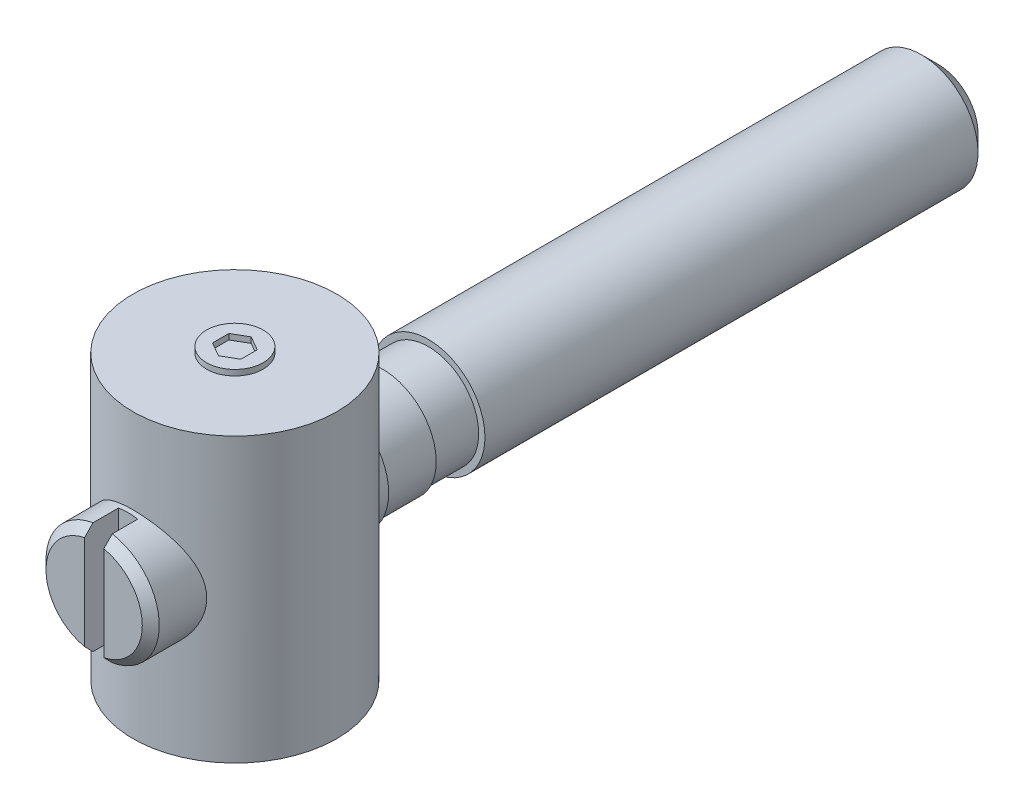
ISO-10303-21;
HEADER;
FILE_DESCRIPTION(('STEP AP214'),'2;1');
FILE_NAME('part.step','',(''),(''),'','','');
FILE_SCHEMA(('AUTOMOTIVE_DESIGN { 1 0 10303 214 1 1 1 1 }'));
ENDSEC;
DATA;
#1=APPLICATION_CONTEXT('core data for automotive mechanical design processes');
#2=APPLICATION_PROTOCOL_DEFINITION('international standard','automotive_design',2000,#1);
#3=PRODUCT_CONTEXT('',#1,'mechanical');
#4=PRODUCT('Part','Part','',(#3));
#5=PRODUCT_RELATED_PRODUCT_CATEGORY('part','',(#4));
#6=PRODUCT_DEFINITION_FORMATION('','',#4);
#7=PRODUCT_DEFINITION_CONTEXT('part definition',#1,'design');
#8=PRODUCT_DEFINITION('design','',#6,#7);
#9=PRODUCT_DEFINITION_SHAPE('','',#8);
#10=(LENGTH_UNIT() NAMED_UNIT(*) SI_UNIT(.MILLI.,.METRE.));
#11=(NAMED_UNIT(*) PLANE_ANGLE_UNIT() SI_UNIT($,.RADIAN.));
#12=(NAMED_UNIT(*) SI_UNIT($,.STERADIAN.) SOLID_ANGLE_UNIT());
#13=UNCERTAINTY_MEASURE_WITH_UNIT(LENGTH_MEASURE(1.E-05),#10,'distance_accuracy_value','');
#14=(GEOMETRIC_REPRESENTATION_CONTEXT(3) GLOBAL_UNCERTAINTY_ASSIGNED_CONTEXT((#13)) GLOBAL_UNIT_ASSIGNED_CONTEXT((#10,
#11,#12)) REPRESENTATION_CONTEXT('',''));
#15=CARTESIAN_POINT('',(0.,0.,0.));
#16=DIRECTION('',(0.,0.,1.));
#17=DIRECTION('',(1.,0.,0.));
#18=AXIS2_PLACEMENT_3D('',#15,#16,#17);
#19=CARTESIAN_POINT('',(0.,0.,12.4245));
#20=DIRECTION('',(0.,0.,-1.));
#21=DIRECTION('',(0.,1.,0.));
#22=AXIS2_PLACEMENT_3D('',#19,#20,#21);
#23=PLANE('',#22);
#24=CARTESIAN_POINT('',(0.,0.,12.4245));
#25=DIRECTION('',(0.,0.,-1.));
#26=DIRECTION('',(0.,1.,0.));
#27=AXIS2_PLACEMENT_3D('',#24,#25,#26);
#28=CIRCLE('',#27,4.25);
#29=CARTESIAN_POINT('',(0.85,-4.1641325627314,12.4245));
#30=VERTEX_POINT('',#29);
#31=CARTESIAN_POINT('',(0.85,4.1641325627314,12.4245));
#32=VERTEX_POINT('',#31);
#33=EDGE_CURVE('E175',#30,#32,#28,.F.);
#34=ORIENTED_EDGE('',*,*,#33,.T.);
#35=DIRECTION('',(0.,1.,0.));
#36=VECTOR('',#35,1.);
#37=CARTESIAN_POINT('',(0.85,4.92722031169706,12.4245));
#38=LINE('',#37,#36);
#39=EDGE_CURVE('E345',#30,#32,#38,.T.);
#40=ORIENTED_EDGE('',*,*,#39,.F.);
#41=EDGE_LOOP('',(#34,#40));
#42=FACE_BOUND('',#41,.T.);
#43=ADVANCED_FACE('F14',(#42),#23,.F.);
#44=CARTESIAN_POINT('',(-0.85,4.1641325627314,12.4245));
#45=VERTEX_POINT('',#44);
#46=CARTESIAN_POINT('',(-0.85,-4.1641325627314,12.4245));
#47=VERTEX_POINT('',#46);
#48=EDGE_CURVE('E176',#45,#47,#28,.F.);
#49=ORIENTED_EDGE('',*,*,#48,.T.);
#50=DIRECTION('',(0.,-1.,0.));
#51=VECTOR('',#50,1.);
#52=CARTESIAN_POINT('',(-0.85,4.92722031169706,12.4245));
#53=LINE('',#52,#51);
#54=EDGE_CURVE('E400',#45,#47,#53,.T.);
#55=ORIENTED_EDGE('',*,*,#54,.F.);
#56=EDGE_LOOP('',(#49,#55));
#57=FACE_BOUND('',#56,.T.);
#58=ADVANCED_FACE('F213',(#57),#23,.F.);
#59=CARTESIAN_POINT('',(0.,0.,12.4245));
#60=DIRECTION('',(0.,0.,-1.));
#61=DIRECTION('',(0.,1.,0.));
#62=AXIS2_PLACEMENT_3D('',#59,#60,#61);
#63=CONICAL_SURFACE('',#62,4.25,0.78539816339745);
#64=CARTESIAN_POINT('',(0.85,-10.8571842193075,5.78409370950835));
#65=CARTESIAN_POINT('',(0.850000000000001,-10.471658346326,6.16843314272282));
#66=CARTESIAN_POINT('',(0.850000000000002,-10.0860798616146,6.55271985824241));
#67=CARTESIAN_POINT('',(0.850000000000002,-9.31472993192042,7.32113134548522));
#68=CARTESIAN_POINT('',(0.850000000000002,-8.92895847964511,7.70525610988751));
#69=CARTESIAN_POINT('',(0.850000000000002,-8.15678249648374,8.47363775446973));
#70=CARTESIAN_POINT('',(0.850000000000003,-7.7703777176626,8.85789438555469));
#71=CARTESIAN_POINT('',(0.850000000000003,-6.99719715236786,9.62600327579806));
#72=CARTESIAN_POINT('',(0.850000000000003,-6.61042138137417,10.0098555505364));
#73=CARTESIAN_POINT('',(0.850000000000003,-5.85479041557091,10.7585441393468));
#74=CARTESIAN_POINT('',(0.850000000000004,-5.4859647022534,11.1234101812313));
#75=CARTESIAN_POINT('',(0.850000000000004,-4.93193044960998,11.6699477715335));
#76=CARTESIAN_POINT('',(0.850000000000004,-4.74710850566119,11.8520110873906));
#77=CARTESIAN_POINT('',(0.850000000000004,-4.37709943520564,12.21576213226));
#78=CARTESIAN_POINT('',(0.850000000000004,-4.19191231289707,12.3974498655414));
#79=CARTESIAN_POINT('',(0.850000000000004,-3.82111814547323,12.7601731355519));
#80=CARTESIAN_POINT('',(0.850000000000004,-3.63551142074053,12.94120899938));
#81=CARTESIAN_POINT('',(0.850000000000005,-3.26347010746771,13.3024446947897));
#82=CARTESIAN_POINT('',(0.850000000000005,-3.07703548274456,13.4826444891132));
#83=CARTESIAN_POINT('',(0.850000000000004,-2.70287506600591,13.8416259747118));
#84=CARTESIAN_POINT('',(0.850000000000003,-2.51514955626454,14.0204079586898));
#85=CARTESIAN_POINT('',(0.850000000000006,-2.231716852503,14.2866057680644));
#86=CARTESIAN_POINT('',(0.850000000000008,-2.13693525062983,14.3750060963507));
#87=CARTESIAN_POINT('',(0.850000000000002,-1.94648080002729,14.5508404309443));
#88=CARTESIAN_POINT('',(0.849999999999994,-1.85080797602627,14.6382744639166));
#89=CARTESIAN_POINT('',(0.850000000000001,-1.727675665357,14.7490832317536));
#90=CARTESIAN_POINT('',(0.850000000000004,-1.70082923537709,14.7731393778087));
#91=CARTESIAN_POINT('',(0.850000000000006,-1.64701809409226,14.8211193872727));
#92=CARTESIAN_POINT('',(0.850000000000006,-1.62005338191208,14.8450432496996));
#93=CARTESIAN_POINT('',(0.850000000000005,-1.53895497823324,14.9165942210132));
#94=CARTESIAN_POINT('',(0.850000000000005,-1.48462201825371,14.9639962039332));
#95=CARTESIAN_POINT('',(0.850000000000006,-1.37483312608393,15.0583713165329));
#96=CARTESIAN_POINT('',(0.850000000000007,-1.31937170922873,15.1053380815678));
#97=CARTESIAN_POINT('',(0.850000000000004,-1.20752807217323,15.1981369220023));
#98=CARTESIAN_POINT('',(0.85,-1.15114610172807,15.2439692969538));
#99=CARTESIAN_POINT('',(0.85,-1.03663150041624,15.3344042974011));
#100=CARTESIAN_POINT('',(0.850000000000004,-0.978488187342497,15.3789934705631));
#101=CARTESIAN_POINT('',(0.850000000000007,-0.860303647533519,15.4657790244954));
#102=CARTESIAN_POINT('',(0.850000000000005,-0.800260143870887,15.5079723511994));
#103=CARTESIAN_POINT('',(0.850000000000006,-0.678046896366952,15.588164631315));
#104=CARTESIAN_POINT('',(0.850000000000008,-0.615896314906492,15.6261924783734));
#105=CARTESIAN_POINT('',(0.850000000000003,-0.488100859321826,15.6957876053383));
#106=CARTESIAN_POINT('',(0.849999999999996,-0.422466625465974,15.7273732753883));
#107=CARTESIAN_POINT('',(0.850000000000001,-0.329088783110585,15.763320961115));
#108=CARTESIAN_POINT('',(0.850000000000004,-0.303167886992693,15.7723966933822));
#109=CARTESIAN_POINT('',(0.850000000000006,-0.250726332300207,15.7886439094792));
#110=CARTESIAN_POINT('',(0.850000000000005,-0.22420565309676,15.7958153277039));
#111=CARTESIAN_POINT('',(0.850000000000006,-0.17075676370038,15.8079066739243));
#112=CARTESIAN_POINT('',(0.850000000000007,-0.143830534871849,15.8128352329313));
#113=CARTESIAN_POINT('',(0.850000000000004,-0.0896414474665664,15.820207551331));
#114=CARTESIAN_POINT('',(0.85,-0.0623786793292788,15.822651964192));
#115=CARTESIAN_POINT('',(0.85,-0.0075372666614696,15.824910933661));
#116=CARTESIAN_POINT('',(0.850000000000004,0.0200422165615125,15.82470572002));
#117=CARTESIAN_POINT('',(0.850000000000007,0.0750465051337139,15.8216369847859));
#118=CARTESIAN_POINT('',(0.850000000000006,0.102471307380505,15.8187734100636));
#119=CARTESIAN_POINT('',(0.850000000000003,0.18431008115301,15.8064148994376));
#120=CARTESIAN_POINT('',(0.85,0.238169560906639,15.7931483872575));
#121=CARTESIAN_POINT('',(0.85,0.341986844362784,15.7595828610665));
#122=CARTESIAN_POINT('',(0.850000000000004,0.392008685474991,15.7394689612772));
#123=CARTESIAN_POINT('',(0.850000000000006,0.489870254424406,15.6944042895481));
#124=CARTESIAN_POINT('',(0.850000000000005,0.537706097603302,15.6694452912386));
#125=CARTESIAN_POINT('',(0.850000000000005,0.631894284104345,15.6160710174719));
#126=CARTESIAN_POINT('',(0.850000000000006,0.678231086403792,15.5876288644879));
#127=CARTESIAN_POINT('',(0.850000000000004,0.76939390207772,15.5285213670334));
#128=CARTESIAN_POINT('',(0.85,0.814221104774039,15.4978578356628));
#129=CARTESIAN_POINT('',(0.85,0.906418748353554,15.4323418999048));
#130=CARTESIAN_POINT('',(0.850000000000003,0.953691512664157,15.3973530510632));
#131=CARTESIAN_POINT('',(0.850000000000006,1.04723694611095,15.3260585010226));
#132=CARTESIAN_POINT('',(0.850000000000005,1.09350947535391,15.2897526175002));
#133=CARTESIAN_POINT('',(0.850000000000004,1.23123275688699,15.1793793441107));
#134=CARTESIAN_POINT('',(0.850000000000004,1.32154148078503,15.1038914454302));
#135=CARTESIAN_POINT('',(0.850000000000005,1.50045598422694,14.9506177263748));
#136=CARTESIAN_POINT('',(0.850000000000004,1.5890582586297,14.8728278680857));
#137=CARTESIAN_POINT('',(0.850000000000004,1.76500186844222,14.7158903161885));
#138=CARTESIAN_POINT('',(0.850000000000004,1.85234357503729,14.636743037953));
#139=CARTESIAN_POINT('',(0.850000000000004,2.02593043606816,14.4777547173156));
#140=CARTESIAN_POINT('',(0.850000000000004,2.11217801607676,14.3979163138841));
#141=CARTESIAN_POINT('',(0.850000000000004,2.28407604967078,14.2375871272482));
#142=CARTESIAN_POINT('',(0.850000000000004,2.3697264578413,14.1570962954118));
#143=CARTESIAN_POINT('',(0.850000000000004,2.54048363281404,13.9957355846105));
#144=CARTESIAN_POINT('',(0.850000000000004,2.62559090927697,13.9148662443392));
#145=CARTESIAN_POINT('',(0.850000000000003,2.79546438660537,13.7527747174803));
#146=CARTESIAN_POINT('',(0.850000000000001,2.88023059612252,13.671552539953));
#147=CARTESIAN_POINT('',(0.849999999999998,3.13203787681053,13.4295009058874));
#148=CARTESIAN_POINT('',(0.850000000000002,3.29870204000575,13.2682794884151));
#149=CARTESIAN_POINT('',(0.850000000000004,3.63138320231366,12.9451699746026));
#150=CARTESIAN_POINT('',(0.850000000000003,3.79740019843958,12.7832818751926));
#151=CARTESIAN_POINT('',(0.850000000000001,4.29480941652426,12.2969477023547));
#152=CARTESIAN_POINT('',(0.850000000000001,4.62555293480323,11.9718384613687));
#153=CARTESIAN_POINT('',(0.850000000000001,5.28633819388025,11.3205425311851));
#154=CARTESIAN_POINT('',(0.850000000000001,5.61637944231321,10.9943553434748));
#155=CARTESIAN_POINT('',(0.85,6.27592616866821,10.3414463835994));
#156=CARTESIAN_POINT('',(0.85,6.60543165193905,10.0147246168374));
#157=CARTESIAN_POINT('',(0.849999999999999,7.26217149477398,9.36286110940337));
#158=CARTESIAN_POINT('',(0.849999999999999,7.58940782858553,9.03772135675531));
#159=CARTESIAN_POINT('',(0.849999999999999,8.24365487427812,8.38721275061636));
#160=CARTESIAN_POINT('',(0.849999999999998,8.57066558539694,8.06184389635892));
#161=CARTESIAN_POINT('',(0.849999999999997,9.22432804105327,7.41114429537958));
#162=CARTESIAN_POINT('',(0.849999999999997,9.55097988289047,7.08581364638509));
#163=CARTESIAN_POINT('',(0.849999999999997,10.2041625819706,6.43503329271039));
#164=CARTESIAN_POINT('',(0.849999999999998,10.5306934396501,6.10958358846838));
#165=CARTESIAN_POINT('',(0.85,10.8571842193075,5.78409370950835));
#166=B_SPLINE_CURVE_WITH_KNOTS('',3,(#64,#65,#66,#67,#68,#69,#70,#71,#72,#73,#74,#75,#76,#77,
#78,#79,#80,#81,#82,#83,#84,#85,#86,#87,#88,#89,#90,#91,#92,#93,#94,#95,#96,#97,#98,#99,#100,
#101,#102,#103,#104,#105,#106,#107,#108,#109,#110,#111,#112,#113,#114,#115,#116,#117,#118,#119,
#120,#121,#122,#123,#124,#125,#126,#127,#128,#129,#130,#131,#132,#133,#134,#135,#136,#137,#138,
#139,#140,#141,#142,#143,#144,#145,#146,#147,#148,#149,#150,#151,#152,#153,#154,#155,#156,#157,
#158,#159,#160,#161,#162,#163,#164,#165),.UNSPECIFIED.,.F.,.F.,(4,2,2,2,2,2,2,2,2,2,2,2,2,2,2,2,
2,2,2,2,2,2,2,2,2,2,2,2,2,2,2,2,2,2,2,2,2,2,2,2,2,2,2,2,2,2,2,2,2,2,4),(0.,1.63313292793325,
3.26633311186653,4.90115899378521,6.53591939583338,8.09233592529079,8.87063870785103,
9.64893259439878,10.4267573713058,11.2046164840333,11.9823105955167,12.3711302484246,
12.7599391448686,12.8680815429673,12.9762247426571,13.192531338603,13.4105501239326,
13.6285107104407,13.8482899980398,14.06834343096,14.2867582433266,14.5045405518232,
14.5868729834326,14.6692082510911,14.7512239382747,14.8332180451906,14.9158243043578,
14.9984322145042,15.1639989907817,15.3254048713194,15.4870872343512,15.6501067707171,
15.8129947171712,15.9894007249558,16.1658312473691,16.5188698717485,16.8725695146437,
17.2261627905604,17.5787425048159,17.9313487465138,18.2835517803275,18.6357458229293,
19.3313885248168,20.0270344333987,21.4183551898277,22.8104494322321,24.2025296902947,
25.5864353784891,26.970345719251,28.3534122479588,29.7364737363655),.UNSPECIFIED.);
#167=CARTESIAN_POINT('',(0.85,-4.92722031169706,11.6745));
#168=VERTEX_POINT('',#167);
#169=EDGE_CURVE('E191',#168,#30,#166,.T.);
#170=ORIENTED_EDGE('',*,*,#169,.F.);
#171=CARTESIAN_POINT('',(0.,0.,11.6745));
#172=DIRECTION('',(0.,0.,-1.));
#173=DIRECTION('',(0.,1.,0.));
#174=AXIS2_PLACEMENT_3D('',#171,#172,#173);
#175=CIRCLE('',#174,5.);
#176=CARTESIAN_POINT('',(0.85,4.92722031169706,11.6745));
#177=VERTEX_POINT('',#176);
#178=EDGE_CURVE('E180',#177,#168,#175,.T.);
#179=ORIENTED_EDGE('',*,*,#178,.F.);
#180=EDGE_CURVE('E183',#32,#177,#166,.T.);
#181=ORIENTED_EDGE('',*,*,#180,.F.);
#182=ORIENTED_EDGE('',*,*,#33,.F.);
#183=EDGE_LOOP('',(#170,#179,#181,#182));
#184=FACE_BOUND('',#183,.T.);
#185=ADVANCED_FACE('F199',(#184),#63,.T.);
#186=CARTESIAN_POINT('',(0.85,4.92722031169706,9.4245));
#187=DIRECTION('',(1.,0.,0.));
#188=DIRECTION('',(0.,1.,0.));
#189=AXIS2_PLACEMENT_3D('',#186,#187,#188);
#190=PLANE('',#189);
#191=ORIENTED_EDGE('',*,*,#169,.T.);
#192=ORIENTED_EDGE('',*,*,#39,.T.);
#193=ORIENTED_EDGE('',*,*,#180,.T.);
#194=DIRECTION('',(0.,0.,1.));
#195=VECTOR('',#194,1.);
#196=CARTESIAN_POINT('',(0.85,4.92722031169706,9.4245));
#197=LINE('',#196,#195);
#198=CARTESIAN_POINT('',(0.85,4.92722031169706,9.4245));
#199=VERTEX_POINT('',#198);
#200=EDGE_CURVE('E416',#199,#177,#197,.T.);
#201=ORIENTED_EDGE('',*,*,#200,.F.);
#202=DIRECTION('',(0.,1.,0.));
#203=VECTOR('',#202,1.);
#204=CARTESIAN_POINT('',(0.85,4.92722031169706,9.4245));
#205=LINE('',#204,#203);
#206=CARTESIAN_POINT('',(0.85,-4.92722031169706,9.4245));
#207=VERTEX_POINT('',#206);
#208=EDGE_CURVE('E87',#207,#199,#205,.T.);
#209=ORIENTED_EDGE('',*,*,#208,.F.);
#210=DIRECTION('',(0.,0.,1.));
#211=VECTOR('',#210,1.);
#212=CARTESIAN_POINT('',(0.85,-4.92722031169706,9.4245));
#213=LINE('',#212,#211);
#214=EDGE_CURVE('E418',#207,#168,#213,.T.);
#215=ORIENTED_EDGE('',*,*,#214,.T.);
#216=EDGE_LOOP('',(#191,#192,#193,#201,#209,#215));
#217=FACE_BOUND('',#216,.T.);
#218=ADVANCED_FACE('F203',(#217),#190,.F.);
#219=CARTESIAN_POINT('',(0.,0.,9.4245));
#220=DIRECTION('',(0.,0.,1.));
#221=DIRECTION('',(0.,-1.,0.));
#222=AXIS2_PLACEMENT_3D('',#219,#220,#221);
#223=PLANE('',#222);
#224=CARTESIAN_POINT('',(0.,0.,9.4245));
#225=DIRECTION('',(0.,0.,1.));
#226=DIRECTION('',(0.,-1.,0.));
#227=AXIS2_PLACEMENT_3D('',#224,#225,#226);
#228=CIRCLE('',#227,5.);
#229=CARTESIAN_POINT('',(-0.85,-4.92722031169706,9.4245));
#230=VERTEX_POINT('',#229);
#231=EDGE_CURVE('E404',#230,#207,#228,.T.);
#232=ORIENTED_EDGE('',*,*,#231,.T.);
#233=ORIENTED_EDGE('',*,*,#208,.T.);
#234=CARTESIAN_POINT('',(0.,0.,9.4245));
#235=DIRECTION('',(0.,0.,1.));
#236=DIRECTION('',(0.,-1.,0.));
#237=AXIS2_PLACEMENT_3D('',#234,#235,#236);
#238=CIRCLE('',#237,5.);
#239=CARTESIAN_POINT('',(-0.85,4.92722031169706,9.4245));
#240=VERTEX_POINT('',#239);
#241=EDGE_CURVE('E422',#199,#240,#238,.T.);
#242=ORIENTED_EDGE('',*,*,#241,.T.);
#243=DIRECTION('',(0.,-1.,0.));
#244=VECTOR('',#243,1.);
#245=CARTESIAN_POINT('',(-0.85,4.92722031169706,9.4245));
#246=LINE('',#245,#244);
#247=EDGE_CURVE('E407',#240,#230,#246,.T.);
#248=ORIENTED_EDGE('',*,*,#247,.T.);
#249=EDGE_LOOP('',(#232,#233,#242,#248));
#250=FACE_BOUND('',#249,.T.);
#251=ADVANCED_FACE('F207',(#250),#223,.T.);
#252=CARTESIAN_POINT('',(-0.85,4.92722031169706,9.4245));
#253=DIRECTION('',(-1.,0.,0.));
#254=DIRECTION('',(0.,-1.,0.));
#255=AXIS2_PLACEMENT_3D('',#252,#253,#254);
#256=PLANE('',#255);
#257=CARTESIAN_POINT('',(-0.85,10.8571842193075,5.78409370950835));
#258=CARTESIAN_POINT('',(-0.850000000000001,10.471658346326,6.16843314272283));
#259=CARTESIAN_POINT('',(-0.850000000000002,10.0860798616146,6.55271985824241));
#260=CARTESIAN_POINT('',(-0.850000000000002,9.31472993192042,7.32113134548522));
#261=CARTESIAN_POINT('',(-0.850000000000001,8.92895847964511,7.70525610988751));
#262=CARTESIAN_POINT('',(-0.850000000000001,8.15678249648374,8.47363775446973));
#263=CARTESIAN_POINT('',(-0.85,7.7703777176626,8.85789438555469));
#264=CARTESIAN_POINT('',(-0.85,6.99719715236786,9.62600327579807));
#265=CARTESIAN_POINT('',(-0.85,6.61042138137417,10.0098555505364));
#266=CARTESIAN_POINT('',(-0.849999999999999,5.85479041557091,10.7585441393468));
#267=CARTESIAN_POINT('',(-0.849999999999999,5.4859647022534,11.1234101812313));
#268=CARTESIAN_POINT('',(-0.849999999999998,4.93193044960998,11.6699477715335));
#269=CARTESIAN_POINT('',(-0.849999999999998,4.74710850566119,11.8520110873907));
#270=CARTESIAN_POINT('',(-0.849999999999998,4.37709943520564,12.2157621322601));
#271=CARTESIAN_POINT('',(-0.849999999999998,4.19191231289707,12.3974498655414));
#272=CARTESIAN_POINT('',(-0.849999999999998,3.82111814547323,12.7601731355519));
#273=CARTESIAN_POINT('',(-0.849999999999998,3.63551142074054,12.94120899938));
#274=CARTESIAN_POINT('',(-0.849999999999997,3.26347010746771,13.3024446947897));
#275=CARTESIAN_POINT('',(-0.849999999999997,3.07703548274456,13.4826444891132));
#276=CARTESIAN_POINT('',(-0.849999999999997,2.70287506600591,13.8416259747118));
#277=CARTESIAN_POINT('',(-0.849999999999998,2.51514955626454,14.0204079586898));
#278=CARTESIAN_POINT('',(-0.849999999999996,2.231716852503,14.2866057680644));
#279=CARTESIAN_POINT('',(-0.849999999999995,2.13693525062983,14.3750060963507));
#280=CARTESIAN_POINT('',(-0.849999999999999,1.94648080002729,14.5508404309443));
#281=CARTESIAN_POINT('',(-0.850000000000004,1.85080797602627,14.6382744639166));
#282=CARTESIAN_POINT('',(-0.849999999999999,1.727675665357,14.7490832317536));
#283=CARTESIAN_POINT('',(-0.849999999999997,1.70082923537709,14.7731393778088));
#284=CARTESIAN_POINT('',(-0.849999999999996,1.64701809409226,14.8211193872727));
#285=CARTESIAN_POINT('',(-0.849999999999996,1.62005338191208,14.8450432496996));
#286=CARTESIAN_POINT('',(-0.849999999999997,1.53895497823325,14.9165942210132));
#287=CARTESIAN_POINT('',(-0.849999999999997,1.48462201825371,14.9639962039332));
#288=CARTESIAN_POINT('',(-0.849999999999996,1.37483312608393,15.0583713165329));
#289=CARTESIAN_POINT('',(-0.849999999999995,1.31937170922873,15.1053380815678));
#290=CARTESIAN_POINT('',(-0.849999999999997,1.20752807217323,15.1981369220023));
#291=CARTESIAN_POINT('',(-0.85,1.15114610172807,15.2439692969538));
#292=CARTESIAN_POINT('',(-0.85,1.03663150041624,15.3344042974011));
#293=CARTESIAN_POINT('',(-0.849999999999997,0.978488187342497,15.3789934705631));
#294=CARTESIAN_POINT('',(-0.849999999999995,0.860303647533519,15.4657790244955));
#295=CARTESIAN_POINT('',(-0.849999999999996,0.800260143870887,15.5079723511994));
#296=CARTESIAN_POINT('',(-0.849999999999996,0.678046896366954,15.588164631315));
#297=CARTESIAN_POINT('',(-0.849999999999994,0.615896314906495,15.6261924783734));
#298=CARTESIAN_POINT('',(-0.849999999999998,0.488100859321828,15.6957876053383));
#299=CARTESIAN_POINT('',(-0.850000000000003,0.422466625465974,15.7273732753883));
#300=CARTESIAN_POINT('',(-0.849999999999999,0.329088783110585,15.763320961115));
#301=CARTESIAN_POINT('',(-0.849999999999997,0.303167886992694,15.7723966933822));
#302=CARTESIAN_POINT('',(-0.849999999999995,0.250726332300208,15.7886439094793));
#303=CARTESIAN_POINT('',(-0.849999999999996,0.224205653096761,15.7958153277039));
#304=CARTESIAN_POINT('',(-0.849999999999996,0.170756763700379,15.8079066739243));
#305=CARTESIAN_POINT('',(-0.849999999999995,0.143830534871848,15.8128352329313));
#306=CARTESIAN_POINT('',(-0.849999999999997,0.0896414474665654,15.820207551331));
#307=CARTESIAN_POINT('',(-0.85,0.0623786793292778,15.822651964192));
#308=CARTESIAN_POINT('',(-0.85,0.00753726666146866,15.824910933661));
#309=CARTESIAN_POINT('',(-0.849999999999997,-0.0200422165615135,15.82470572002));
#310=CARTESIAN_POINT('',(-0.849999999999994,-0.075046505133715,15.8216369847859));
#311=CARTESIAN_POINT('',(-0.849999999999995,-0.102471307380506,15.8187734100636));
#312=CARTESIAN_POINT('',(-0.849999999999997,-0.184310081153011,15.8064148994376));
#313=CARTESIAN_POINT('',(-0.85,-0.23816956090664,15.7931483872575));
#314=CARTESIAN_POINT('',(-0.85,-0.341986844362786,15.7595828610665));
#315=CARTESIAN_POINT('',(-0.849999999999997,-0.392008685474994,15.7394689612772));
#316=CARTESIAN_POINT('',(-0.849999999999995,-0.48987025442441,15.6944042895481));
#317=CARTESIAN_POINT('',(-0.849999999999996,-0.537706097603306,15.6694452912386));
#318=CARTESIAN_POINT('',(-0.849999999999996,-0.631894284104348,15.6160710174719));
#319=CARTESIAN_POINT('',(-0.849999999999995,-0.678231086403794,15.5876288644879));
#320=CARTESIAN_POINT('',(-0.849999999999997,-0.769393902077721,15.5285213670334));
#321=CARTESIAN_POINT('',(-0.85,-0.81422110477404,15.4978578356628));
#322=CARTESIAN_POINT('',(-0.85,-0.906418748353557,15.4323418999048));
#323=CARTESIAN_POINT('',(-0.849999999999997,-0.95369151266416,15.3973530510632));
#324=CARTESIAN_POINT('',(-0.849999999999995,-1.04723694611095,15.3260585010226));
#325=CARTESIAN_POINT('',(-0.849999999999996,-1.09350947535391,15.2897526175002));
#326=CARTESIAN_POINT('',(-0.849999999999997,-1.23123275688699,15.1793793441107));
#327=CARTESIAN_POINT('',(-0.849999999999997,-1.32154148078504,15.1038914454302));
#328=CARTESIAN_POINT('',(-0.849999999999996,-1.50045598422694,14.9506177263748));
#329=CARTESIAN_POINT('',(-0.849999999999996,-1.58905825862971,14.8728278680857));
#330=CARTESIAN_POINT('',(-0.849999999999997,-1.76500186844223,14.7158903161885));
#331=CARTESIAN_POINT('',(-0.849999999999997,-1.85234357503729,14.636743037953));
#332=CARTESIAN_POINT('',(-0.849999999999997,-2.02593043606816,14.4777547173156));
#333=CARTESIAN_POINT('',(-0.849999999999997,-2.11217801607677,14.3979163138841));
#334=CARTESIAN_POINT('',(-0.849999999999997,-2.28407604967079,14.2375871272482));
#335=CARTESIAN_POINT('',(-0.849999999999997,-2.36972645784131,14.1570962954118));
#336=CARTESIAN_POINT('',(-0.849999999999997,-2.54048363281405,13.9957355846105));
#337=CARTESIAN_POINT('',(-0.849999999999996,-2.62559090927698,13.9148662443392));
#338=CARTESIAN_POINT('',(-0.849999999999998,-2.79546438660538,13.7527747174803));
#339=CARTESIAN_POINT('',(-0.849999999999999,-2.88023059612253,13.671552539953));
#340=CARTESIAN_POINT('',(-0.850000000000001,-3.13203787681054,13.4295009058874));
#341=CARTESIAN_POINT('',(-0.849999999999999,-3.29870204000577,13.2682794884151));
#342=CARTESIAN_POINT('',(-0.849999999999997,-3.63138320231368,12.9451699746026));
#343=CARTESIAN_POINT('',(-0.849999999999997,-3.7974001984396,12.7832818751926));
#344=CARTESIAN_POINT('',(-0.849999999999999,-4.29480941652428,12.2969477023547));
#345=CARTESIAN_POINT('',(-0.849999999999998,-4.62555293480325,11.9718384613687));
#346=CARTESIAN_POINT('',(-0.849999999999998,-5.28633819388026,11.3205425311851));
#347=CARTESIAN_POINT('',(-0.849999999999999,-5.61637944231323,10.9943553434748));
#348=CARTESIAN_POINT('',(-0.849999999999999,-6.27592616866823,10.3414463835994));
#349=CARTESIAN_POINT('',(-0.85,-6.60543165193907,10.0147246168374));
#350=CARTESIAN_POINT('',(-0.85,-7.26217149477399,9.36286110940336));
#351=CARTESIAN_POINT('',(-0.85,-7.58940782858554,9.03772135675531));
#352=CARTESIAN_POINT('',(-0.850000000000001,-8.24365487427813,8.38721275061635));
#353=CARTESIAN_POINT('',(-0.850000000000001,-8.57066558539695,8.06184389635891));
#354=CARTESIAN_POINT('',(-0.850000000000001,-9.22432804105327,7.41114429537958));
#355=CARTESIAN_POINT('',(-0.850000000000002,-9.55097988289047,7.08581364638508));
#356=CARTESIAN_POINT('',(-0.850000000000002,-10.2041625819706,6.43503329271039));
#357=CARTESIAN_POINT('',(-0.850000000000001,-10.5306934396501,6.10958358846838));
#358=CARTESIAN_POINT('',(-0.85,-10.8571842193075,5.78409370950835));
#359=B_SPLINE_CURVE_WITH_KNOTS('',3,(#257,#258,#259,#260,#261,#262,#263,#264,#265,#266,#267,
#268,#269,#270,#271,#272,#273,#274,#275,#276,#277,#278,#279,#280,#281,#282,#283,#284,#285,#286,
#287,#288,#289,#290,#291,#292,#293,#294,#295,#296,#297,#298,#299,#300,#301,#302,#303,#304,#305,
#306,#307,#308,#309,#310,#311,#312,#313,#314,#315,#316,#317,#318,#319,#320,#321,#322,#323,#324,
#325,#326,#327,#328,#329,#330,#331,#332,#333,#334,#335,#336,#337,#338,#339,#340,#341,#342,#343,
#344,#345,#346,#347,#348,#349,#350,#351,#352,#353,#354,#355,#356,#357,#358),.UNSPECIFIED.,.F.,
.F.,(4,2,2,2,2,2,2,2,2,2,2,2,2,2,2,2,2,2,2,2,2,2,2,2,2,2,2,2,2,2,2,2,2,2,2,2,2,2,2,2,2,2,2,2,2,
2,2,2,2,2,4),(0.,1.63313292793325,3.26633311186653,4.90115899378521,6.53591939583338,
8.09233592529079,8.87063870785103,9.64893259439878,10.4267573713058,11.2046164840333,
11.9823105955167,12.3711302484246,12.7599391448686,12.8680815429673,12.9762247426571,
13.192531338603,13.4105501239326,13.6285107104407,13.8482899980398,14.06834343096,
14.2867582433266,14.5045405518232,14.5868729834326,14.6692082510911,14.7512239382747,
14.8332180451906,14.9158243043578,14.9984322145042,15.1639989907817,15.3254048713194,
15.4870872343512,15.6501067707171,15.8129947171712,15.9894007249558,16.1658312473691,
16.5188698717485,16.8725695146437,17.2261627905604,17.5787425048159,17.9313487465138,
18.2835517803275,18.6357458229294,19.3313885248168,20.0270344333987,21.4183551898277,
22.8104494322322,24.2025296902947,25.5864353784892,26.9703457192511,28.3534122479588,
29.7364737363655),.UNSPECIFIED.);
#360=CARTESIAN_POINT('',(-0.85,4.92722031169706,11.6745));
#361=VERTEX_POINT('',#360);
#362=EDGE_CURVE('E435',#361,#45,#359,.T.);
#363=ORIENTED_EDGE('',*,*,#362,.T.);
#364=ORIENTED_EDGE('',*,*,#54,.T.);
#365=CARTESIAN_POINT('',(-0.85,-4.92722031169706,11.6745));
#366=VERTEX_POINT('',#365);
#367=EDGE_CURVE('E192',#47,#366,#359,.T.);
#368=ORIENTED_EDGE('',*,*,#367,.T.);
#369=DIRECTION('',(0.,0.,1.));
#370=VECTOR('',#369,1.);
#371=CARTESIAN_POINT('',(-0.85,-4.92722031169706,9.4245));
#372=LINE('',#371,#370);
#373=EDGE_CURVE('E410',#230,#366,#372,.T.);
#374=ORIENTED_EDGE('',*,*,#373,.F.);
#375=ORIENTED_EDGE('',*,*,#247,.F.);
#376=DIRECTION('',(0.,0.,1.));
#377=VECTOR('',#376,1.);
#378=CARTESIAN_POINT('',(-0.85,4.92722031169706,9.4245));
#379=LINE('',#378,#377);
#380=EDGE_CURVE('E414',#240,#361,#379,.T.);
#381=ORIENTED_EDGE('',*,*,#380,.T.);
#382=EDGE_LOOP('',(#363,#364,#368,#374,#375,#381));
#383=FACE_BOUND('',#382,.T.);
#384=ADVANCED_FACE('F208',(#383),#256,.F.);
#385=ORIENTED_EDGE('',*,*,#362,.F.);
#386=EDGE_CURVE('E179',#366,#361,#175,.T.);
#387=ORIENTED_EDGE('',*,*,#386,.F.);
#388=ORIENTED_EDGE('',*,*,#367,.F.);
#389=ORIENTED_EDGE('',*,*,#48,.F.);
#390=EDGE_LOOP('',(#385,#387,#388,#389));
#391=FACE_BOUND('',#390,.T.);
#392=ADVANCED_FACE('F293',(#391),#63,.T.);
#393=CARTESIAN_POINT('',(0.,0.,42.719865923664));
#394=DIRECTION('',(0.,0.,1.));
#395=DIRECTION('',(0.,-1.,0.));
#396=AXIS2_PLACEMENT_3D('',#393,#394,#395);
#397=CYLINDRICAL_SURFACE('',#396,5.);
#398=ORIENTED_EDGE('',*,*,#386,.T.);
#399=ORIENTED_EDGE('',*,*,#380,.F.);
#400=ORIENTED_EDGE('',*,*,#241,.F.);
#401=ORIENTED_EDGE('',*,*,#200,.T.);
#402=ORIENTED_EDGE('',*,*,#178,.T.);
#403=ORIENTED_EDGE('',*,*,#214,.F.);
#404=ORIENTED_EDGE('',*,*,#231,.F.);
#405=ORIENTED_EDGE('',*,*,#373,.T.);
#406=EDGE_LOOP('',(#398,#399,#400,#401,#402,#403,#404,#405));
#407=FACE_BOUND('',#406,.T.);
#408=CARTESIAN_POINT('',(0.,-5.,9.));
#409=CARTESIAN_POINT('',(-0.129728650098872,-5.00000040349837,9.00000035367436));
#410=CARTESIAN_POINT('',(-0.259452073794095,-4.99494572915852,8.99718916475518));
#411=CARTESIAN_POINT('',(-0.517921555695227,-4.9747929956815,8.98601661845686));
#412=CARTESIAN_POINT('',(-0.646667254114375,-4.95969140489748,8.97765330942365));
#413=CARTESIAN_POINT('',(-0.902114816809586,-4.91964430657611,8.955591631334));
#414=CARTESIAN_POINT('',(-1.02881719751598,-4.89470132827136,8.94189463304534));
#415=CARTESIAN_POINT('',(-1.27935747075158,-4.83526936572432,8.90950110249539));
#416=CARTESIAN_POINT('',(-1.40319416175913,-4.80077645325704,8.89080251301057));
#417=CARTESIAN_POINT('',(-1.64664425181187,-4.72279881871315,8.84894060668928));
#418=CARTESIAN_POINT('',(-1.76627303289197,-4.67935197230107,8.82579612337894));
#419=CARTESIAN_POINT('',(-2.00118015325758,-4.58381684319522,8.77551906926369));
#420=CARTESIAN_POINT('',(-2.1164568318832,-4.53172530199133,8.74838499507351));
#421=CARTESIAN_POINT('',(-2.45478877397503,-4.36318845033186,8.6618736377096));
#422=CARTESIAN_POINT('',(-2.67053417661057,-4.23441988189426,8.59735346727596));
#423=CARTESIAN_POINT('',(-3.09271229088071,-3.93780768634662,8.45507241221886));
#424=CARTESIAN_POINT('',(-3.29745415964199,-3.76786951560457,8.37670278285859));
#425=CARTESIAN_POINT('',(-3.67715998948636,-3.39835387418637,8.21711406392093));
#426=CARTESIAN_POINT('',(-3.85209353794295,-3.19874651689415,8.13589216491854));
#427=CARTESIAN_POINT('',(-4.18516795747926,-2.75130582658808,7.97009263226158));
#428=CARTESIAN_POINT('',(-4.33981028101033,-2.50063516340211,7.88600912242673));
#429=CARTESIAN_POINT('',(-4.53792036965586,-2.10454112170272,7.77258662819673));
#430=CARTESIAN_POINT('',(-4.59831134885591,-1.96917342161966,7.73689861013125));
#431=CARTESIAN_POINT('',(-4.70719976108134,-1.69244684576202,7.67113380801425));
#432=CARTESIAN_POINT('',(-4.75570081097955,-1.55108980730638,7.64105531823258));
#433=CARTESIAN_POINT('',(-4.86451848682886,-1.17999431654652,7.57250099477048));
#434=CARTESIAN_POINT('',(-4.9154532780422,-0.946409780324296,7.53922489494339));
#435=CARTESIAN_POINT('',(-4.98336969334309,-0.472499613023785,7.49451395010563));
#436=CARTESIAN_POINT('',(-5.00038478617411,-0.232180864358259,7.48305757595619));
#437=CARTESIAN_POINT('',(-4.99960164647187,0.248654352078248,7.48358103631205));
#438=CARTESIAN_POINT('',(-4.98176529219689,0.489170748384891,7.49558653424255));
#439=CARTESIAN_POINT('',(-4.91220969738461,0.963158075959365,7.54134329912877));
#440=CARTESIAN_POINT('',(-4.8604684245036,1.19662432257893,7.57510870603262));
#441=CARTESIAN_POINT('',(-4.725553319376,1.65086354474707,7.65998850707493));
#442=CARTESIAN_POINT('',(-4.64237249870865,1.87163368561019,7.71110675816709));
#443=CARTESIAN_POINT('',(-4.447403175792,2.29681665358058,7.82517266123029));
#444=CARTESIAN_POINT('',(-4.33560350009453,2.50122305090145,7.88812493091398));
#445=CARTESIAN_POINT('',(-4.06693738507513,2.92082028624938,8.03034742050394));
#446=CARTESIAN_POINT('',(-3.90580419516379,3.13292950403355,8.11064361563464));
#447=CARTESIAN_POINT('',(-3.55190169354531,3.52909892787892,8.2717439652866));
#448=CARTESIAN_POINT('',(-3.35910741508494,3.7131367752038,8.3525484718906));
#449=CARTESIAN_POINT('',(-3.0382033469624,3.97377961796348,8.47255594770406));
#450=CARTESIAN_POINT('',(-2.91988181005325,4.06153890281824,8.51415799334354));
#451=CARTESIAN_POINT('',(-2.67521853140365,4.22669686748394,8.59416899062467));
#452=CARTESIAN_POINT('',(-2.54887988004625,4.30409950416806,8.63257915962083));
#453=CARTESIAN_POINT('',(-2.28891079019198,4.44780208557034,8.70511911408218));
#454=CARTESIAN_POINT('',(-2.15528226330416,4.51410492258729,8.73925001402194));
#455=CARTESIAN_POINT('',(-1.88158110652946,4.63486956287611,8.8022360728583));
#456=CARTESIAN_POINT('',(-1.74150926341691,4.68933280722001,8.83109187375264));
#457=CARTESIAN_POINT('',(-1.46611496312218,4.78227003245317,8.88080389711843));
#458=CARTESIAN_POINT('',(-1.33115857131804,4.82160315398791,8.90208189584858));
#459=CARTESIAN_POINT('',(-1.05765459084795,4.88888456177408,8.9387020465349));
#460=CARTESIAN_POINT('',(-0.919107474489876,4.91683433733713,8.95404497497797));
#461=CARTESIAN_POINT('',(-0.639688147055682,4.96092635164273,8.97833234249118));
#462=CARTESIAN_POINT('',(-0.49881761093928,4.97707674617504,8.98728120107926));
#463=CARTESIAN_POINT('',(-0.215954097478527,4.99734561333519,8.99852157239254));
#464=CARTESIAN_POINT('',(-0.0739612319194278,5.00146526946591,9.00081373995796));
#465=CARTESIAN_POINT('',(0.193661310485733,4.99783122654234,8.99879540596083));
#466=CARTESIAN_POINT('',(0.319316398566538,4.99137388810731,8.99520578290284));
#467=CARTESIAN_POINT('',(0.569568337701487,4.96904196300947,8.98283315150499));
#468=CARTESIAN_POINT('',(0.694164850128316,4.9531644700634,8.97404854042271));
#469=CARTESIAN_POINT('',(0.941327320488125,4.91218729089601,8.95149651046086));
#470=CARTESIAN_POINT('',(1.06389401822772,4.88709104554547,8.93773095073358));
#471=CARTESIAN_POINT('',(1.30624674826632,4.82797111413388,8.90554320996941));
#472=CARTESIAN_POINT('',(1.42603168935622,4.7939439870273,8.88711923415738));
#473=CARTESIAN_POINT('',(1.77910695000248,4.67928639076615,8.82561614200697));
#474=CARTESIAN_POINT('',(2.00729552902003,4.58588050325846,8.77619255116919));
#475=CARTESIAN_POINT('',(2.44488800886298,4.36833983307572,8.66450874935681));
#476=CARTESIAN_POINT('',(2.65428686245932,4.24419682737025,8.6022451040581));
#477=CARTESIAN_POINT('',(3.07172957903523,3.95417802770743,8.46272453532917));
#478=CARTESIAN_POINT('',(3.27740782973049,3.7853191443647,8.38458363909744));
#479=CARTESIAN_POINT('',(3.65908152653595,3.41781320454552,8.22520611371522));
#480=CARTESIAN_POINT('',(3.83504389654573,3.21913341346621,8.14396615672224));
#481=CARTESIAN_POINT('',(4.17023823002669,2.7738769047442,7.97793731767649));
#482=CARTESIAN_POINT('',(4.32600004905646,2.52449151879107,7.89361512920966));
#483=CARTESIAN_POINT('',(4.59275891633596,1.99831062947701,7.74146523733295));
#484=CARTESIAN_POINT('',(4.70381927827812,1.7215545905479,7.67361425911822));
#485=CARTESIAN_POINT('',(4.85777774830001,1.20756607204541,7.57683809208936));
#486=CARTESIAN_POINT('',(4.91005771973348,0.97411746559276,7.5427474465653));
#487=CARTESIAN_POINT('',(4.98067851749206,0.500106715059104,7.49631291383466));
#488=CARTESIAN_POINT('',(4.99905324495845,0.259551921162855,7.48394730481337));
#489=CARTESIAN_POINT('',(5.00087641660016,-0.222043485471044,7.48272923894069));
#490=CARTESIAN_POINT('',(4.98428138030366,-0.463084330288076,7.49390605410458));
#491=CARTESIAN_POINT('',(4.91703272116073,-0.938336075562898,7.5381922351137));
#492=CARTESIAN_POINT('',(4.86635734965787,-1.17254251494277,7.57131560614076));
#493=CARTESIAN_POINT('',(4.73359019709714,-1.62763734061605,7.65501053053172));
#494=CARTESIAN_POINT('',(4.65159333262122,-1.84856365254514,7.70552932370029));
#495=CARTESIAN_POINT('',(4.45898685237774,-2.27421802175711,7.81855933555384));
#496=CARTESIAN_POINT('',(4.34836621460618,-2.47893979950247,7.88107517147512));
#497=CARTESIAN_POINT('',(4.08239378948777,-2.89911833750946,8.02246926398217));
#498=CARTESIAN_POINT('',(3.92281334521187,-3.11154387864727,8.10239358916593));
#499=CARTESIAN_POINT('',(3.57208449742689,-3.50861520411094,8.26301218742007));
#500=CARTESIAN_POINT('',(3.38091059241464,-3.69323831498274,8.34370703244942));
#501=CARTESIAN_POINT('',(3.06226198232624,-3.95526647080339,8.46388232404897));
#502=CARTESIAN_POINT('',(2.944544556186,-4.04369106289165,8.50565265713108));
#503=CARTESIAN_POINT('',(2.7010491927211,-4.21023353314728,8.58607842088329));
#504=CARTESIAN_POINT('',(2.5752743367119,-4.28835531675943,8.62473502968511));
#505=CARTESIAN_POINT('',(2.31639114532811,-4.43354865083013,8.69784009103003));
#506=CARTESIAN_POINT('',(2.1832852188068,-4.5006238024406,8.73228991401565));
#507=CARTESIAN_POINT('',(1.91056755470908,-4.62299222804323,8.79598351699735));
#508=CARTESIAN_POINT('',(1.77095673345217,-4.67828715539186,8.825228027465));
#509=CARTESIAN_POINT('',(1.4991287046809,-4.77193637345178,8.87524400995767));
#510=CARTESIAN_POINT('',(1.36737917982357,-4.81136832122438,8.89654158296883));
#511=CARTESIAN_POINT('',(1.10033791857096,-4.87936809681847,8.93349970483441));
#512=CARTESIAN_POINT('',(0.965046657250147,-4.90793737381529,8.94916100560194));
#513=CARTESIAN_POINT('',(0.692088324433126,-4.95380200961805,8.97439622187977));
#514=CARTESIAN_POINT('',(0.554422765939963,-4.97110429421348,8.98397387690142));
#515=CARTESIAN_POINT('',(0.277836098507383,-4.9942027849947,8.99677541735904));
#516=CARTESIAN_POINT('',(0.138915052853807,-4.99999956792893,8.9999996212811));
#517=CARTESIAN_POINT('',(0.,-5.,9.));
#518=B_SPLINE_CURVE_WITH_KNOTS('',3,(#408,#409,#410,#411,#412,#413,#414,#415,#416,#417,#418,
#419,#420,#421,#422,#423,#424,#425,#426,#427,#428,#429,#430,#431,#432,#433,#434,#435,#436,#437,
#438,#439,#440,#441,#442,#443,#444,#445,#446,#447,#448,#449,#450,#451,#452,#453,#454,#455,#456,
#457,#458,#459,#460,#461,#462,#463,#464,#465,#466,#467,#468,#469,#470,#471,#472,#473,#474,#475,
#476,#477,#478,#479,#480,#481,#482,#483,#484,#485,#486,#487,#488,#489,#490,#491,#492,#493,#494,
#495,#496,#497,#498,#499,#500,#501,#502,#503,#504,#505,#506,#507,#508,#509,#510,#511,#512,#513,
#514,#515,#516,#517),.UNSPECIFIED.,.T.,.F.,(4,2,2,2,2,2,2,2,2,2,2,2,2,2,2,2,2,2,2,2,2,2,2,2,2,2,
2,2,2,2,2,2,2,2,2,2,2,2,2,2,2,2,2,2,2,2,2,2,2,2,2,2,2,2,4),(0.,0.389049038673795,
0.778234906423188,1.1673208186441,1.5565670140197,1.94419928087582,2.33197799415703,
3.10694003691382,3.93579164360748,4.76548390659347,5.67926108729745,6.13607645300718,
6.59275268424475,7.31346839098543,8.03347261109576,8.75426483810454,9.47552592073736,
10.1969474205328,10.9186510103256,11.7500289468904,12.5820656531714,13.0407937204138,
13.4993460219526,13.9577786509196,14.4161554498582,14.8420733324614,15.2679354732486,
15.6935029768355,16.1190286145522,16.4961868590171,16.8734615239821,17.2505955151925,
17.6278750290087,18.3788772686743,19.1300806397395,19.9587345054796,20.7883047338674,
21.7014293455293,22.613256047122,23.335047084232,24.0561160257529,24.778082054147,
25.5005092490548,26.2207643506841,26.9412972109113,27.7704094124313,28.6001941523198,
29.0588132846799,29.5172580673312,29.9755531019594,30.4337837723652,30.8507153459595,
31.2675912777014,31.6842107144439,32.100809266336),.UNSPECIFIED.);
#519=CARTESIAN_POINT('',(0.,-5.,9.));
#520=VERTEX_POINT('',#519);
#521=EDGE_CURVE('E226',#520,#520,#518,.T.);
#522=ORIENTED_EDGE('',*,*,#521,.F.);
#523=EDGE_LOOP('',(#522));
#524=FACE_BOUND('',#523,.T.);
#525=ADVANCED_FACE('F222',(#407,#524),#397,.T.);
#526=CARTESIAN_POINT('',(0.,12.5,0.));
#527=DIRECTION('',(0.,1.,0.));
#528=DIRECTION('',(1.,0.,0.));
#529=AXIS2_PLACEMENT_3D('',#526,#527,#528);
#530=PLANE('',#529);
#531=DIRECTION('',(0.,0.,-1.));
#532=VECTOR('',#531,1.);
#533=CARTESIAN_POINT('',(-1.25,12.5,-0.721687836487));
#534=LINE('',#533,#532);
#535=CARTESIAN_POINT('',(-1.25,12.5,0.721687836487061));
#536=VERTEX_POINT('',#535);
#537=CARTESIAN_POINT('',(-1.25,12.5,-0.721687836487));
#538=VERTEX_POINT('',#537);
#539=EDGE_CURVE('E334',#536,#538,#534,.T.);
#540=ORIENTED_EDGE('',*,*,#539,.F.);
#541=DIRECTION('',(-0.866025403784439,0.,-0.5));
#542=VECTOR('',#541,1.);
#543=CARTESIAN_POINT('',(-1.25,12.5,0.721687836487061));
#544=LINE('',#543,#542);
#545=CARTESIAN_POINT('',(0.,12.5,1.4433756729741));
#546=VERTEX_POINT('',#545);
#547=EDGE_CURVE('E339',#546,#536,#544,.T.);
#548=ORIENTED_EDGE('',*,*,#547,.F.);
#549=DIRECTION('',(-0.866025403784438,0.,0.5));
#550=VECTOR('',#549,1.);
#551=CARTESIAN_POINT('',(0.,12.5,1.4433756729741));
#552=LINE('',#551,#550);
#553=CARTESIAN_POINT('',(1.25,12.5,0.721687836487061));
#554=VERTEX_POINT('',#553);
#555=EDGE_CURVE('E377',#554,#546,#552,.T.);
#556=ORIENTED_EDGE('',*,*,#555,.F.);
#557=DIRECTION('',(0.,0.,1.));
#558=VECTOR('',#557,1.);
#559=CARTESIAN_POINT('',(1.25,12.5,0.721687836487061));
#560=LINE('',#559,#558);
#561=CARTESIAN_POINT('',(1.25,12.5,-0.721687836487));
#562=VERTEX_POINT('',#561);
#563=EDGE_CURVE('E380',#562,#554,#560,.T.);
#564=ORIENTED_EDGE('',*,*,#563,.F.);
#565=DIRECTION('',(0.866025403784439,0.,0.5));
#566=VECTOR('',#565,1.);
#567=CARTESIAN_POINT('',(1.25,12.5,-0.721687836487));
#568=LINE('',#567,#566);
#569=CARTESIAN_POINT('',(0.,12.5,-1.44337567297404));
#570=VERTEX_POINT('',#569);
#571=EDGE_CURVE('E79',#570,#562,#568,.T.);
#572=ORIENTED_EDGE('',*,*,#571,.F.);
#573=DIRECTION('',(0.866025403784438,0.,-0.5));
#574=VECTOR('',#573,1.);
#575=CARTESIAN_POINT('',(0.,12.5,-1.44337567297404));
#576=LINE('',#575,#574);
#577=EDGE_CURVE('E383',#538,#570,#576,.T.);
#578=ORIENTED_EDGE('',*,*,#577,.F.);
#579=EDGE_LOOP('',(#540,#548,#556,#564,#572,#578));
#580=FACE_BOUND('',#579,.T.);
#581=ADVANCED_FACE('F282',(#580),#530,.T.);
#582=CARTESIAN_POINT('',(-1.25,11.,-0.721687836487));
#583=DIRECTION('',(-1.,0.,0.));
#584=DIRECTION('',(0.,0.,1.));
#585=AXIS2_PLACEMENT_3D('',#582,#583,#584);
#586=PLANE('',#585);
#587=DIRECTION('',(0.,1.,0.));
#588=VECTOR('',#587,1.);
#589=CARTESIAN_POINT('',(-1.25,11.,0.721687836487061));
#590=LINE('',#589,#588);
#591=CARTESIAN_POINT('',(-1.25,13.,0.721687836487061));
#592=VERTEX_POINT('',#591);
#593=EDGE_CURVE('E354',#536,#592,#590,.T.);
#594=ORIENTED_EDGE('',*,*,#593,.F.);
#595=ORIENTED_EDGE('',*,*,#539,.T.);
#596=DIRECTION('',(0.,1.,0.));
#597=VECTOR('',#596,1.);
#598=CARTESIAN_POINT('',(-1.25,11.,-0.721687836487));
#599=LINE('',#598,#597);
#600=CARTESIAN_POINT('',(-1.25,13.,-0.721687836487));
#601=VERTEX_POINT('',#600);
#602=EDGE_CURVE('E351',#538,#601,#599,.T.);
#603=ORIENTED_EDGE('',*,*,#602,.T.);
#604=DIRECTION('',(0.,0.,1.));
#605=VECTOR('',#604,1.);
#606=CARTESIAN_POINT('',(-1.25,13.,-0.721687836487));
#607=LINE('',#606,#605);
#608=EDGE_CURVE('E369',#601,#592,#607,.T.);
#609=ORIENTED_EDGE('',*,*,#608,.T.);
#610=EDGE_LOOP('',(#594,#595,#603,#609));
#611=FACE_BOUND('',#610,.T.);
#612=ADVANCED_FACE('F284',(#611),#586,.F.);
#613=CARTESIAN_POINT('',(-1.25,11.,0.721687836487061));
#614=DIRECTION('',(-0.5,0.,0.866025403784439));
#615=DIRECTION('',(0.866025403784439,0.,0.5));
#616=AXIS2_PLACEMENT_3D('',#613,#614,#615);
#617=PLANE('',#616);
#618=DIRECTION('',(0.,1.,0.));
#619=VECTOR('',#618,1.);
#620=CARTESIAN_POINT('',(0.,11.,1.4433756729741));
#621=LINE('',#620,#619);
#622=CARTESIAN_POINT('',(0.,13.,1.4433756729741));
#623=VERTEX_POINT('',#622);
#624=EDGE_CURVE('E356',#546,#623,#621,.T.);
#625=ORIENTED_EDGE('',*,*,#624,.F.);
#626=ORIENTED_EDGE('',*,*,#547,.T.);
#627=ORIENTED_EDGE('',*,*,#593,.T.);
#628=DIRECTION('',(0.866025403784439,0.,0.5));
#629=VECTOR('',#628,1.);
#630=CARTESIAN_POINT('',(-1.25,13.,0.721687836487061));
#631=LINE('',#630,#629);
#632=EDGE_CURVE('E366',#592,#623,#631,.T.);
#633=ORIENTED_EDGE('',*,*,#632,.T.);
#634=EDGE_LOOP('',(#625,#626,#627,#633));
#635=FACE_BOUND('',#634,.T.);
#636=ADVANCED_FACE('F290',(#635),#617,.F.);
#637=CARTESIAN_POINT('',(0.,11.,1.4433756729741));
#638=DIRECTION('',(0.5,0.,0.866025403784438));
#639=DIRECTION('',(0.866025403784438,0.,-0.5));
#640=AXIS2_PLACEMENT_3D('',#637,#638,#639);
#641=PLANE('',#640);
#642=DIRECTION('',(0.,1.,0.));
#643=VECTOR('',#642,1.);
#644=CARTESIAN_POINT('',(1.25,11.,0.721687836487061));
#645=LINE('',#644,#643);
#646=CARTESIAN_POINT('',(1.25,13.,0.721687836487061));
#647=VERTEX_POINT('',#646);
#648=EDGE_CURVE('E358',#554,#647,#645,.T.);
#649=ORIENTED_EDGE('',*,*,#648,.F.);
#650=ORIENTED_EDGE('',*,*,#555,.T.);
#651=ORIENTED_EDGE('',*,*,#624,.T.);
#652=DIRECTION('',(0.866025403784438,0.,-0.5));
#653=VECTOR('',#652,1.);
#654=CARTESIAN_POINT('',(0.,13.,1.4433756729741));
#655=LINE('',#654,#653);
#656=EDGE_CURVE('E363',#623,#647,#655,.T.);
#657=ORIENTED_EDGE('',*,*,#656,.T.);
#658=EDGE_LOOP('',(#649,#650,#651,#657));
#659=FACE_BOUND('',#658,.T.);
#660=ADVANCED_FACE('F300',(#659),#641,.F.);
#661=CARTESIAN_POINT('',(1.25,11.,0.721687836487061));
#662=DIRECTION('',(1.,0.,0.));
#663=DIRECTION('',(0.,0.,-1.));
#664=AXIS2_PLACEMENT_3D('',#661,#662,#663);
#665=PLANE('',#664);
#666=DIRECTION('',(0.,1.,0.));
#667=VECTOR('',#666,1.);
#668=CARTESIAN_POINT('',(1.25,11.,-0.721687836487));
#669=LINE('',#668,#667);
#670=CARTESIAN_POINT('',(1.25,13.,-0.721687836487));
#671=VERTEX_POINT('',#670);
#672=EDGE_CURVE('E349',#562,#671,#669,.T.);
#673=ORIENTED_EDGE('',*,*,#672,.F.);
#674=ORIENTED_EDGE('',*,*,#563,.T.);
#675=ORIENTED_EDGE('',*,*,#648,.T.);
#676=DIRECTION('',(0.,0.,-1.));
#677=VECTOR('',#676,1.);
#678=CARTESIAN_POINT('',(1.25,13.,0.721687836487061));
#679=LINE('',#678,#677);
#680=EDGE_CURVE('E352',#647,#671,#679,.T.);
#681=ORIENTED_EDGE('',*,*,#680,.T.);
#682=EDGE_LOOP('',(#673,#674,#675,#681));
#683=FACE_BOUND('',#682,.T.);
#684=ADVANCED_FACE('F296',(#683),#665,.F.);
#685=CARTESIAN_POINT('',(1.25,11.,-0.721687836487));
#686=DIRECTION('',(0.5,0.,-0.86602540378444));
#687=DIRECTION('',(-0.86602540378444,0.,-0.5));
#688=AXIS2_PLACEMENT_3D('',#685,#686,#687);
#689=PLANE('',#688);
#690=DIRECTION('',(0.,1.,0.));
#691=VECTOR('',#690,1.);
#692=CARTESIAN_POINT('',(0.,11.,-1.44337567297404));
#693=LINE('',#692,#691);
#694=CARTESIAN_POINT('',(0.,13.,-1.44337567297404));
#695=VERTEX_POINT('',#694);
#696=EDGE_CURVE('E73',#570,#695,#693,.T.);
#697=ORIENTED_EDGE('',*,*,#696,.F.);
#698=ORIENTED_EDGE('',*,*,#571,.T.);
#699=ORIENTED_EDGE('',*,*,#672,.T.);
#700=DIRECTION('',(-0.86602540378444,0.,-0.5));
#701=VECTOR('',#700,1.);
#702=CARTESIAN_POINT('',(1.25,13.,-0.721687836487));
#703=LINE('',#702,#701);
#704=EDGE_CURVE('E337',#671,#695,#703,.T.);
#705=ORIENTED_EDGE('',*,*,#704,.T.);
#706=EDGE_LOOP('',(#697,#698,#699,#705));
#707=FACE_BOUND('',#706,.T.);
#708=ADVANCED_FACE('F299',(#707),#689,.F.);
#709=CARTESIAN_POINT('',(0.,11.,-1.44337567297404));
#710=DIRECTION('',(-0.5,0.,-0.866025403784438));
#711=DIRECTION('',(-0.866025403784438,0.,0.5));
#712=AXIS2_PLACEMENT_3D('',#709,#710,#711);
#713=PLANE('',#712);
#714=ORIENTED_EDGE('',*,*,#602,.F.);
#715=ORIENTED_EDGE('',*,*,#577,.T.);
#716=ORIENTED_EDGE('',*,*,#696,.T.);
#717=DIRECTION('',(-0.866025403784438,0.,0.5));
#718=VECTOR('',#717,1.);
#719=CARTESIAN_POINT('',(0.,13.,-1.44337567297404));
#720=LINE('',#719,#718);
#721=EDGE_CURVE('E372',#695,#601,#720,.T.);
#722=ORIENTED_EDGE('',*,*,#721,.T.);
#723=EDGE_LOOP('',(#714,#715,#716,#722));
#724=FACE_BOUND('',#723,.T.);
#725=ADVANCED_FACE('F308',(#724),#713,.F.);
#726=CARTESIAN_POINT('',(0.,13.,0.));
#727=DIRECTION('',(0.,-1.,0.));
#728=DIRECTION('',(0.,0.,1.));
#729=AXIS2_PLACEMENT_3D('',#726,#727,#728);
#730=PLANE('',#729);
#731=ORIENTED_EDGE('',*,*,#721,.F.);
#732=ORIENTED_EDGE('',*,*,#704,.F.);
#733=ORIENTED_EDGE('',*,*,#680,.F.);
#734=ORIENTED_EDGE('',*,*,#656,.F.);
#735=ORIENTED_EDGE('',*,*,#632,.F.);
#736=ORIENTED_EDGE('',*,*,#608,.F.);
#737=EDGE_LOOP('',(#731,#732,#733,#734,#735,#736));
#738=FACE_BOUND('',#737,.T.);
#739=CARTESIAN_POINT('',(0.,13.,0.));
#740=DIRECTION('',(0.,-1.,0.));
#741=DIRECTION('',(0.,0.,1.));
#742=AXIS2_PLACEMENT_3D('',#739,#740,#741);
#743=CIRCLE('',#742,2.5);
#744=CARTESIAN_POINT('',(0.,13.,2.5));
#745=VERTEX_POINT('',#744);
#746=EDGE_CURVE('E346',#745,#745,#743,.T.);
#747=ORIENTED_EDGE('',*,*,#746,.F.);
#748=EDGE_LOOP('',(#747));
#749=FACE_BOUND('',#748,.T.);
#750=ADVANCED_FACE('F311',(#738,#749),#730,.F.);
#751=CARTESIAN_POINT('',(0.,8.,0.));
#752=DIRECTION('',(0.,-1.,0.));
#753=DIRECTION('',(0.,0.,1.));
#754=AXIS2_PLACEMENT_3D('',#751,#752,#753);
#755=CYLINDRICAL_SURFACE('',#754,2.5);
#756=ORIENTED_EDGE('',*,*,#746,.T.);
#757=EDGE_LOOP('',(#756));
#758=FACE_BOUND('',#757,.T.);
#759=CARTESIAN_POINT('',(0.,12.5,0.));
#760=DIRECTION('',(0.,-1.,0.));
#761=DIRECTION('',(0.,0.,-1.));
#762=AXIS2_PLACEMENT_3D('',#759,#760,#761);
#763=CIRCLE('',#762,2.5);
#764=CARTESIAN_POINT('',(0.,12.5,-2.5));
#765=VERTEX_POINT('',#764);
#766=EDGE_CURVE('E342',#765,#765,#763,.T.);
#767=ORIENTED_EDGE('',*,*,#766,.F.);
#768=EDGE_LOOP('',(#767));
#769=FACE_BOUND('',#768,.T.);
#770=ADVANCED_FACE('F317',(#758,#769),#755,.T.);
#771=CARTESIAN_POINT('',(0.,-12.5,0.));
#772=DIRECTION('',(0.,-1.,0.));
#773=DIRECTION('',(-1.,0.,0.));
#774=AXIS2_PLACEMENT_3D('',#771,#772,#773);
#775=PLANE('',#774);
#776=CARTESIAN_POINT('',(0.,-12.5,0.));
#777=DIRECTION('',(0.,-1.,0.));
#778=DIRECTION('',(-1.,0.,0.));
#779=AXIS2_PLACEMENT_3D('',#776,#777,#778);
#780=CIRCLE('',#779,9.);
#781=CARTESIAN_POINT('',(-9.00000000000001,-12.5,0.));
#782=VERTEX_POINT('',#781);
#783=EDGE_CURVE('E331',#782,#782,#780,.T.);
#784=ORIENTED_EDGE('',*,*,#783,.T.);
#785=EDGE_LOOP('',(#784));
#786=FACE_BOUND('',#785,.T.);
#787=ADVANCED_FACE('F320',(#786),#775,.T.);
#788=CARTESIAN_POINT('',(0.,12.5,0.));
#789=DIRECTION('',(0.,-1.,0.));
#790=DIRECTION('',(-1.,0.,0.));
#791=AXIS2_PLACEMENT_3D('',#788,#789,#790);
#792=PLANE('',#791);
#793=CARTESIAN_POINT('',(0.,12.5,0.));
#794=DIRECTION('',(0.,1.,0.));
#795=DIRECTION('',(1.,0.,0.));
#796=AXIS2_PLACEMENT_3D('',#793,#794,#795);
#797=CIRCLE('',#796,9.);
#798=CARTESIAN_POINT('',(9.,12.5,0.));
#799=VERTEX_POINT('',#798);
#800=EDGE_CURVE('E333',#799,#799,#797,.T.);
#801=ORIENTED_EDGE('',*,*,#800,.T.);
#802=EDGE_LOOP('',(#801));
#803=FACE_BOUND('',#802,.T.);
#804=ORIENTED_EDGE('',*,*,#766,.T.);
#805=EDGE_LOOP('',(#804));
#806=FACE_BOUND('',#805,.T.);
#807=ADVANCED_FACE('F245',(#803,#806),#792,.F.);
#808=CARTESIAN_POINT('',(0.,-12.5,0.));
#809=DIRECTION('',(0.,1.,0.));
#810=DIRECTION('',(1.,0.,0.));
#811=AXIS2_PLACEMENT_3D('',#808,#809,#810);
#812=CYLINDRICAL_SURFACE('',#811,9.);
#813=ORIENTED_EDGE('',*,*,#521,.T.);
#814=EDGE_LOOP('',(#813));
#815=FACE_BOUND('',#814,.T.);
#816=ORIENTED_EDGE('',*,*,#800,.F.);
#817=EDGE_LOOP('',(#816));
#818=FACE_BOUND('',#817,.T.);
#819=ORIENTED_EDGE('',*,*,#783,.F.);
#820=EDGE_LOOP('',(#819));
#821=FACE_BOUND('',#820,.T.);
#822=DIRECTION('',(0.,1.,0.));
#823=VECTOR('',#822,1.);
#824=CARTESIAN_POINT('',(2.73144645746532,-12.5,-8.5755));
#825=LINE('',#824,#823);
#826=CARTESIAN_POINT('',(2.73144645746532,-3.8248137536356,-8.5755));
#827=VERTEX_POINT('',#826);
#828=CARTESIAN_POINT('',(2.73144645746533,-4.18798283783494,-8.5755));
#829=VERTEX_POINT('',#828);
#830=EDGE_CURVE('E146',#827,#829,#825,.F.);
#831=ORIENTED_EDGE('',*,*,#830,.T.);
#832=CARTESIAN_POINT('',(2.73144645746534,-4.18798283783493,-8.5755));
#833=CARTESIAN_POINT('',(2.85360375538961,-4.10830553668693,-8.53660291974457));
#834=CARTESIAN_POINT('',(2.97187432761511,-4.02355433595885,-8.49604479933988));
#835=CARTESIAN_POINT('',(3.20010381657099,-3.84452584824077,-8.41273060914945));
#836=CARTESIAN_POINT('',(3.31006450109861,-3.75025059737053,-8.36997501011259));
#837=CARTESIAN_POINT('',(3.52168528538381,-3.55229657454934,-8.28316869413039));
#838=CARTESIAN_POINT('',(3.6233038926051,-3.44857564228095,-8.23911282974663));
#839=CARTESIAN_POINT('',(3.81714328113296,-3.23272257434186,-8.15112041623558));
#840=CARTESIAN_POINT('',(3.90936349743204,-3.12058993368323,-8.10718387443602));
#841=CARTESIAN_POINT('',(4.17130193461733,-2.77209958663,-7.97734997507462));
#842=CARTESIAN_POINT('',(4.32640759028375,-2.52354691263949,-7.89338127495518));
#843=CARTESIAN_POINT('',(4.52553292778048,-2.13098368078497,-7.77980930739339));
#844=CARTESIAN_POINT('',(4.58628997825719,-1.99693566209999,-7.74403512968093));
#845=CARTESIAN_POINT('',(4.69612299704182,-1.72285053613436,-7.67792354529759));
#846=CARTESIAN_POINT('',(4.74520209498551,-1.58281504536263,-7.64758468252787));
#847=CARTESIAN_POINT('',(4.85634240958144,-1.21325673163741,-7.57776668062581));
#848=CARTESIAN_POINT('',(4.90892874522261,-0.979766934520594,-7.54348534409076));
#849=CARTESIAN_POINT('',(4.98013090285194,-0.505662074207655,-7.49667752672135));
#850=CARTESIAN_POINT('',(4.99877252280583,-0.265052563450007,-7.48413452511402));
#851=CARTESIAN_POINT('',(5.0011107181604,0.216728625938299,-7.48257303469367));
#852=CARTESIAN_POINT('',(4.98476471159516,0.45790063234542,-7.49358321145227));
#853=CARTESIAN_POINT('',(4.91797407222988,0.933416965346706,-7.53757657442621));
#854=CARTESIAN_POINT('',(4.86751219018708,1.16775777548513,-7.570570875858));
#855=CARTESIAN_POINT('',(4.73519063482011,1.62295876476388,-7.65401776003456));
#856=CARTESIAN_POINT('',(4.65345191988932,1.84386712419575,-7.70440301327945));
#857=CARTESIAN_POINT('',(4.46132638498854,2.26962489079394,-7.81722114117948));
#858=CARTESIAN_POINT('',(4.35091534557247,2.47446052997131,-7.87966418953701));
#859=CARTESIAN_POINT('',(4.08530585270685,2.89502813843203,-8.02098408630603));
#860=CARTESIAN_POINT('',(3.9258579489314,3.10771694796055,-8.100917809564));
#861=CARTESIAN_POINT('',(3.57567544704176,3.50492223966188,-8.26144745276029));
#862=CARTESIAN_POINT('',(3.38498021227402,3.68947361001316,-8.34204241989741));
#863=CARTESIAN_POINT('',(3.10880636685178,3.91713248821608,-8.44637212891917));
#864=CARTESIAN_POINT('',(3.03557789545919,3.97415570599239,-8.47299039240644));
#865=CARTESIAN_POINT('',(2.88591224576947,4.08412913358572,-8.52512581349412));
#866=CARTESIAN_POINT('',(2.80947949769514,4.13708469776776,-8.55064439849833));
#867=CARTESIAN_POINT('',(2.73144645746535,4.18798283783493,-8.5755));
#868=B_SPLINE_CURVE_WITH_KNOTS('',3,(#832,#833,#834,#835,#836,#837,#838,#839,#840,#841,#842,
#843,#844,#845,#846,#847,#848,#849,#850,#851,#852,#853,#854,#855,#856,#857,#858,#859,#860,#861,
#862,#863,#864,#865,#866,#867),.UNSPECIFIED.,.F.,.F.,(4,2,2,2,2,2,2,2,2,2,2,2,2,2,2,2,2,4),(0.,
0.452625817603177,0.905155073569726,1.35981367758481,1.81449959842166,2.72340484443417,
3.17725586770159,3.63098512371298,4.35291790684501,5.07430179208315,5.79656414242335,
6.51919194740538,7.23905289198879,7.95952389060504,8.78904079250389,9.61752064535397,
9.90706961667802,10.1962306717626),.UNSPECIFIED.);
#869=CARTESIAN_POINT('',(2.73144645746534,4.18798283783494,-8.5755));
#870=VERTEX_POINT('',#869);
#871=EDGE_CURVE('E140',#829,#870,#868,.T.);
#872=ORIENTED_EDGE('',*,*,#871,.T.);
#873=CARTESIAN_POINT('',(2.73144645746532,3.8248137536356,-8.5755));
#874=VERTEX_POINT('',#873);
#875=EDGE_CURVE('E134',#870,#874,#825,.F.);
#876=ORIENTED_EDGE('',*,*,#875,.T.);
#877=CARTESIAN_POINT('',(0.,-4.7,-9.));
#878=CARTESIAN_POINT('',(0.122929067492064,-4.70000016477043,-9.00000012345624));
#879=CARTESIAN_POINT('',(0.245856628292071,-4.69517204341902,-8.99747591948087));
#880=CARTESIAN_POINT('',(0.490797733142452,-4.675918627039,-8.98744388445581));
#881=CARTESIAN_POINT('',(0.612810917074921,-4.66148973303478,-8.97993418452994));
#882=CARTESIAN_POINT('',(0.855099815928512,-4.62318786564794,-8.96011147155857));
#883=CARTESIAN_POINT('',(0.975373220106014,-4.59930334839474,-8.94779258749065));
#884=CARTESIAN_POINT('',(1.21321772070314,-4.54236333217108,-8.91865836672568));
#885=CARTESIAN_POINT('',(1.33078769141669,-4.50930408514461,-8.9018411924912));
#886=CARTESIAN_POINT('',(1.56189430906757,-4.43454246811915,-8.86420482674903));
#887=CARTESIAN_POINT('',(1.67544659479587,-4.3928792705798,-8.84340380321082));
#888=CARTESIAN_POINT('',(1.89842255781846,-4.30122558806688,-8.79823612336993));
#889=CARTESIAN_POINT('',(2.00784465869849,-4.25123196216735,-8.77386812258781));
#890=CARTESIAN_POINT('',(2.32891484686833,-4.08943816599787,-8.69623446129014));
#891=CARTESIAN_POINT('',(2.53360771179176,-3.96574627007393,-8.63839818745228));
#892=CARTESIAN_POINT('',(2.93285794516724,-3.68134442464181,-8.51146874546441));
#893=CARTESIAN_POINT('',(3.12591896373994,-3.51876658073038,-8.44189105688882));
#894=CARTESIAN_POINT('',(3.483442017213,-3.16527019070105,-8.30075949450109));
#895=CARTESIAN_POINT('',(3.64788011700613,-2.9743281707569,-8.22920402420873));
#896=CARTESIAN_POINT('',(3.95784373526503,-2.54956672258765,-8.08499741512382));
#897=CARTESIAN_POINT('',(4.10050249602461,-2.31346698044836,-8.01278700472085));
#898=CARTESIAN_POINT('',(4.28267476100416,-1.94109610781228,-7.91602438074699));
#899=CARTESIAN_POINT('',(4.33810923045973,-1.81389065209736,-7.88568757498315));
#900=CARTESIAN_POINT('',(4.43778773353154,-1.55414030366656,-7.83002534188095));
#901=CARTESIAN_POINT('',(4.48203866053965,-1.42159875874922,-7.80469682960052));
#902=CARTESIAN_POINT('',(4.55639813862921,-1.1604029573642,-7.76150588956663));
#903=CARTESIAN_POINT('',(4.58720675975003,-1.032007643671,-7.74328125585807));
#904=CARTESIAN_POINT('',(4.63797556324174,-0.772434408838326,-7.71297997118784));
#905=CARTESIAN_POINT('',(4.65794176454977,-0.64125807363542,-7.70089990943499));
#906=CARTESIAN_POINT('',(4.68670698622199,-0.377338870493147,-7.68342782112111));
#907=CARTESIAN_POINT('',(4.69551428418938,-0.244597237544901,-7.67803083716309));
#908=CARTESIAN_POINT('',(4.70183186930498,0.0212471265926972,-7.67416396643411));
#909=CARTESIAN_POINT('',(4.69934342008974,0.154349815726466,-7.67569330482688));
#910=CARTESIAN_POINT('',(4.68420388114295,0.401847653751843,-7.68493960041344));
#911=CARTESIAN_POINT('',(4.67295688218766,0.516363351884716,-7.69180140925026));
#912=CARTESIAN_POINT('',(4.6421799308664,0.743885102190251,-7.71041356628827));
#913=CARTESIAN_POINT('',(4.62264741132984,0.85689067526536,-7.7221654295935));
#914=CARTESIAN_POINT('',(4.5519391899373,1.19247635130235,-7.76420923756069));
#915=CARTESIAN_POINT('',(4.48864283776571,1.41178245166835,-7.80129608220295));
#916=CARTESIAN_POINT('',(4.33054249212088,1.84121660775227,-7.89016560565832));
#917=CARTESIAN_POINT('',(4.23505081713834,2.05101991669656,-7.94226507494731));
#918=CARTESIAN_POINT('',(4.0157943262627,2.45270680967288,-8.05534582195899));
#919=CARTESIAN_POINT('',(3.89201685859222,2.64458232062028,-8.11633106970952));
#920=CARTESIAN_POINT('',(3.5995798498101,3.03318146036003,-8.25059954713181));
#921=CARTESIAN_POINT('',(3.42706286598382,3.22682310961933,-8.32440918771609));
#922=CARTESIAN_POINT('',(3.05172482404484,3.58385306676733,-8.46920001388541));
#923=CARTESIAN_POINT('',(2.84888679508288,3.74722431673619,-8.54017958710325));
#924=CARTESIAN_POINT('',(2.51904259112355,3.97031412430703,-8.64110550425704));
#925=CARTESIAN_POINT('',(2.40142105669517,4.04256540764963,-8.67460906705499));
#926=CARTESIAN_POINT('',(2.15953307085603,4.17678356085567,-8.73796390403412));
#927=CARTESIAN_POINT('',(2.03526947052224,4.23875479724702,-8.76781672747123));
#928=CARTESIAN_POINT('',(1.78095389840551,4.35173059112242,-8.82298880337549));
#929=CARTESIAN_POINT('',(1.65090455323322,4.40274006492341,-8.84831008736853));
#930=CARTESIAN_POINT('',(1.38594747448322,4.49318764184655,-8.89366076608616));
#931=CARTESIAN_POINT('',(1.2510403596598,4.53262721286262,-8.91369083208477));
#932=CARTESIAN_POINT('',(0.989511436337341,4.59645154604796,-8.94632238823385));
#933=CARTESIAN_POINT('',(0.863198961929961,4.6218523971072,-8.95942088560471));
#934=CARTESIAN_POINT('',(0.608489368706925,4.6622271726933,-8.98031527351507));
#935=CARTESIAN_POINT('',(0.480092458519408,4.67720213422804,-8.98811169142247));
#936=CARTESIAN_POINT('',(0.222341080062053,4.69651575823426,-8.99817717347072));
#937=CARTESIAN_POINT('',(0.0929870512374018,4.70085903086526,-9.00044863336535));
#938=CARTESIAN_POINT('',(-0.165612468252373,4.69886040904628,-8.99940485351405));
#939=CARTESIAN_POINT('',(-0.294857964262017,4.69251907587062,-8.99608990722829));
#940=CARTESIAN_POINT('',(-0.540990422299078,4.67025196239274,-8.98449629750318));
#941=CARTESIAN_POINT('',(-0.657979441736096,4.65520258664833,-8.97667174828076));
#942=CARTESIAN_POINT('',(-0.890165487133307,4.61643412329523,-8.95662820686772));
#943=CARTESIAN_POINT('',(-1.00536193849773,4.59271231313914,-8.94440783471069));
#944=CARTESIAN_POINT('',(-1.23314036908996,4.53686092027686,-8.91585832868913));
#945=CARTESIAN_POINT('',(-1.34572315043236,4.50473395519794,-8.89953047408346));
#946=CARTESIAN_POINT('',(-1.56765390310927,4.43239277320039,-8.86313357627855));
#947=CARTESIAN_POINT('',(-1.67700061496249,4.39217545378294,-8.84306309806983));
#948=CARTESIAN_POINT('',(-2.00482526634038,4.25762005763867,-8.77673453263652));
#949=CARTESIAN_POINT('',(-2.21725961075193,4.150814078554,-8.72511731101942));
#950=CARTESIAN_POINT('',(-2.62172706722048,3.90798285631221,-8.61224719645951));
#951=CARTESIAN_POINT('',(-2.81375188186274,3.77194579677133,-8.55099040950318));
#952=CARTESIAN_POINT('',(-3.19343439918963,3.45815190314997,-8.41704144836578));
#953=CARTESIAN_POINT('',(-3.37853230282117,3.27751898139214,-8.34382341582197));
#954=CARTESIAN_POINT('',(-3.71711555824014,2.88785054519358,-8.19860027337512));
#955=CARTESIAN_POINT('',(-3.87057411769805,2.67879120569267,-8.12659623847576));
#956=CARTESIAN_POINT('',(-4.07827615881,2.34022720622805,-8.02335077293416));
#957=CARTESIAN_POINT('',(-4.14529771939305,2.21939342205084,-7.98882909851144));
#958=CARTESIAN_POINT('',(-4.26876757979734,1.97149015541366,-7.9235404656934));
#959=CARTESIAN_POINT('',(-4.32522066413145,1.84442352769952,-7.89277181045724));
#960=CARTESIAN_POINT('',(-4.42689308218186,1.58493573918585,-7.83619843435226));
#961=CARTESIAN_POINT('',(-4.47212238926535,1.45251945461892,-7.81038931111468));
#962=CARTESIAN_POINT('',(-4.55078764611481,1.1832146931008,-7.7648183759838));
#963=CARTESIAN_POINT('',(-4.58422561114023,1.046326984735,-7.74505553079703));
#964=CARTESIAN_POINT('',(-4.63609457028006,0.782849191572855,-7.71410698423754));
#965=CARTESIAN_POINT('',(-4.65567315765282,0.656560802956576,-7.70227161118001));
#966=CARTESIAN_POINT('',(-4.68448863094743,0.40239045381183,-7.68478066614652));
#967=CARTESIAN_POINT('',(-4.69372682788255,0.274508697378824,-7.6791243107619));
#968=CARTESIAN_POINT('',(-4.70170985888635,0.0183555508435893,-7.67423914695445));
#969=CARTESIAN_POINT('',(-4.70045962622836,-0.109915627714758,-7.67500731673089));
#970=CARTESIAN_POINT('',(-4.68749906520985,-0.365722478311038,-7.6829297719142));
#971=CARTESIAN_POINT('',(-4.67578932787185,-0.493258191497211,-7.69008369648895));
#972=CARTESIAN_POINT('',(-4.64400182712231,-0.73218045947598,-7.70931561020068));
#973=CARTESIAN_POINT('',(-4.62501646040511,-0.843766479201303,-7.72074744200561));
#974=CARTESIAN_POINT('',(-4.57919233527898,-1.06477758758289,-7.74801270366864));
#975=CARTESIAN_POINT('',(-4.55235118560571,-1.17420200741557,-7.76384747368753));
#976=CARTESIAN_POINT('',(-4.46044931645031,-1.498238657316,-7.81725439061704));
#977=CARTESIAN_POINT('',(-4.38399074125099,-1.70875728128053,-7.86074163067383));
#978=CARTESIAN_POINT('',(-4.19739084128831,-2.12792324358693,-7.9620244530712));
#979=CARTESIAN_POINT('',(-4.08536350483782,-2.33553507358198,-8.02057350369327));
#980=CARTESIAN_POINT('',(-3.8327146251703,-2.73043361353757,-8.14432794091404));
#981=CARTESIAN_POINT('',(-3.69207772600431,-2.91770932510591,-8.20953689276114));
#982=CARTESIAN_POINT('',(-3.36377364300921,-3.29324783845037,-8.34991601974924));
#983=CARTESIAN_POINT('',(-3.17230519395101,-3.47814426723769,-8.42522907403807));
#984=CARTESIAN_POINT('',(-2.75913422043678,-3.81418227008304,-8.56941791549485));
#985=CARTESIAN_POINT('',(-2.53741349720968,-3.96530338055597,-8.63828978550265));
#986=CARTESIAN_POINT('',(-2.18385403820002,-4.16408175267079,-8.73190226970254));
#987=CARTESIAN_POINT('',(-2.06125481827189,-4.22613580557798,-8.76172252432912));
#988=CARTESIAN_POINT('',(-1.81028904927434,-4.3395602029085,-8.81699040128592));
#989=CARTESIAN_POINT('',(-1.6819253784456,-4.39093580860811,-8.84244017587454));
#990=CARTESIAN_POINT('',(-1.42062184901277,-4.48229363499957,-8.8881605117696));
#991=CARTESIAN_POINT('',(-1.28769212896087,-4.5222994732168,-8.90844179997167));
#992=CARTESIAN_POINT('',(-1.01816379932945,-4.59049529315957,-8.94325359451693));
#993=CARTESIAN_POINT('',(-0.881567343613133,-4.61869205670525,-8.95778740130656));
#994=CARTESIAN_POINT('',(-0.621099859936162,-4.66043647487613,-8.97938687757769));
#995=CARTESIAN_POINT('',(-0.497484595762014,-4.67525568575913,-8.98709885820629));
#996=CARTESIAN_POINT('',(-0.249245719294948,-4.69503747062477,-8.99740541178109));
#997=CARTESIAN_POINT('',(-0.124622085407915,-4.6999998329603,-8.99999987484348));
#998=CARTESIAN_POINT('',(0.,-4.7,-9.));
#999=B_SPLINE_CURVE_WITH_KNOTS('',3,(#877,#878,#879,#880,#881,#882,#883,#884,#885,#886,#887,
#888,#889,#890,#891,#892,#893,#894,#895,#896,#897,#898,#899,#900,#901,#902,#903,#904,#905,#906,
#907,#908,#909,#910,#911,#912,#913,#914,#915,#916,#917,#918,#919,#920,#921,#922,#923,#924,#925,
#926,#927,#928,#929,#930,#931,#932,#933,#934,#935,#936,#937,#938,#939,#940,#941,#942,#943,#944,
#945,#946,#947,#948,#949,#950,#951,#952,#953,#954,#955,#956,#957,#958,#959,#960,#961,#962,#963,
#964,#965,#966,#967,#968,#969,#970,#971,#972,#973,#974,#975,#976,#977,#978,#979,#980,#981,#982,
#983,#984,#985,#986,#987,#988,#989,#990,#991,#992,#993,#994,#995,#996,#997,#998),.UNSPECIFIED.,
.T.,.F.,(4,2,2,2,2,2,2,2,2,2,2,2,2,2,2,2,2,2,2,2,2,2,2,2,2,2,2,2,2,2,2,2,2,2,2,2,2,2,2,2,2,2,2,
2,2,2,2,2,2,2,2,2,2,2,2,2,2,2,2,2,4),(0.,0.368664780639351,0.737467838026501,1.10672254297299,
1.47612831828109,1.84388792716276,2.2117865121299,2.94682225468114,3.72908725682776,
4.51200329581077,5.36264905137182,5.78825271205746,6.21359339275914,6.61288880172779,
7.01196232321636,7.41073964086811,7.80947234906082,8.15486271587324,8.50036017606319,
9.19088850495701,9.8972142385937,10.6038565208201,11.409428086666,12.2154522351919,
12.6411151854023,13.0665968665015,13.4918873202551,13.9171237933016,14.3051128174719,
14.6930632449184,15.0808454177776,15.4686072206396,15.8228311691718,16.1771664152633,
16.531391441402,16.8857525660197,17.6124181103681,18.3393779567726,19.1424108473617,
19.946120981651,20.3729109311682,20.7995071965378,21.2257230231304,21.6518659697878,
22.03634520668,22.4207756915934,22.805025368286,23.1892533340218,23.5301581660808,
23.8711668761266,24.5527547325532,25.2792119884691,26.0060601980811,26.8322932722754,
27.6590255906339,28.0803572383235,28.5014808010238,28.9217230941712,29.3417237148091,
29.7154578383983,30.089199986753),.UNSPECIFIED.);
#1000=CARTESIAN_POINT('',(-2.73144645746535,3.8248137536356,-8.5755));
#1001=VERTEX_POINT('',#1000);
#1002=EDGE_CURVE('E137',#874,#1001,#999,.T.);
#1003=ORIENTED_EDGE('',*,*,#1002,.T.);
#1004=DIRECTION('',(0.,1.,0.));
#1005=VECTOR('',#1004,1.);
#1006=CARTESIAN_POINT('',(-2.73144645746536,-12.5,-8.5755));
#1007=LINE('',#1006,#1005);
#1008=CARTESIAN_POINT('',(-2.73144645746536,4.18798283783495,-8.5755));
#1009=VERTEX_POINT('',#1008);
#1010=EDGE_CURVE('E634',#1001,#1009,#1007,.T.);
#1011=ORIENTED_EDGE('',*,*,#1010,.T.);
#1012=CARTESIAN_POINT('',(-2.73144645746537,4.18798283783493,-8.5755));
#1013=CARTESIAN_POINT('',(-2.85360375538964,4.10830553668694,-8.53660291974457));
#1014=CARTESIAN_POINT('',(-2.97187432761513,4.02355433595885,-8.49604479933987));
#1015=CARTESIAN_POINT('',(-3.20010381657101,3.84452584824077,-8.41273060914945));
#1016=CARTESIAN_POINT('',(-3.31006450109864,3.75025059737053,-8.36997501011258));
#1017=CARTESIAN_POINT('',(-3.52168528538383,3.55229657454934,-8.28316869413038));
#1018=CARTESIAN_POINT('',(-3.62330389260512,3.44857564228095,-8.23911282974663));
#1019=CARTESIAN_POINT('',(-3.81714328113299,3.23272257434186,-8.15112041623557));
#1020=CARTESIAN_POINT('',(-3.90936349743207,3.12058993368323,-8.10718387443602));
#1021=CARTESIAN_POINT('',(-4.17130193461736,2.77209958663,-7.97734997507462));
#1022=CARTESIAN_POINT('',(-4.32640759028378,2.52354691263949,-7.89338127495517));
#1023=CARTESIAN_POINT('',(-4.52553292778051,2.13098368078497,-7.77980930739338));
#1024=CARTESIAN_POINT('',(-4.58628997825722,1.99693566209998,-7.74403512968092));
#1025=CARTESIAN_POINT('',(-4.69612299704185,1.72285053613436,-7.67792354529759));
#1026=CARTESIAN_POINT('',(-4.74520209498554,1.58281504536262,-7.64758468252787));
#1027=CARTESIAN_POINT('',(-4.85634240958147,1.21325673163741,-7.57776668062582));
#1028=CARTESIAN_POINT('',(-4.90892874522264,0.97976693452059,-7.54348534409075));
#1029=CARTESIAN_POINT('',(-4.98013090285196,0.505662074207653,-7.49667752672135));
#1030=CARTESIAN_POINT('',(-4.99877252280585,0.265052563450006,-7.48413452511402));
#1031=CARTESIAN_POINT('',(-5.00111071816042,-0.216728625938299,-7.48257303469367));
#1032=CARTESIAN_POINT('',(-4.98476471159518,-0.45790063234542,-7.49358321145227));
#1033=CARTESIAN_POINT('',(-4.9179740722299,-0.933416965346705,-7.53757657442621));
#1034=CARTESIAN_POINT('',(-4.8675121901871,-1.16775777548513,-7.570570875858));
#1035=CARTESIAN_POINT('',(-4.73519063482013,-1.62295876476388,-7.65401776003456));
#1036=CARTESIAN_POINT('',(-4.65345191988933,-1.84386712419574,-7.70440301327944));
#1037=CARTESIAN_POINT('',(-4.46132638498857,-2.26962489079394,-7.81722114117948));
#1038=CARTESIAN_POINT('',(-4.3509153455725,-2.4744605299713,-7.87966418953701));
#1039=CARTESIAN_POINT('',(-4.08530585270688,-2.89502813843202,-8.02098408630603));
#1040=CARTESIAN_POINT('',(-3.92585794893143,-3.10771694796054,-8.100917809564));
#1041=CARTESIAN_POINT('',(-3.57567544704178,-3.50492223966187,-8.26144745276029));
#1042=CARTESIAN_POINT('',(-3.38498021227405,-3.68947361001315,-8.34204241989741));
#1043=CARTESIAN_POINT('',(-3.10880636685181,-3.91713248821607,-8.44637212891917));
#1044=CARTESIAN_POINT('',(-3.03557789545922,-3.97415570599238,-8.47299039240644));
#1045=CARTESIAN_POINT('',(-2.8859122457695,-4.08412913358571,-8.52512581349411));
#1046=CARTESIAN_POINT('',(-2.80947949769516,-4.13708469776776,-8.55064439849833));
#1047=CARTESIAN_POINT('',(-2.73144645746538,-4.18798283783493,-8.5755));
#1048=B_SPLINE_CURVE_WITH_KNOTS('',3,(#1012,#1013,#1014,#1015,#1016,#1017,#1018,#1019,#1020,
#1021,#1022,#1023,#1024,#1025,#1026,#1027,#1028,#1029,#1030,#1031,#1032,#1033,#1034,#1035,#1036,
#1037,#1038,#1039,#1040,#1041,#1042,#1043,#1044,#1045,#1046,#1047),.UNSPECIFIED.,.F.,.F.,(4,2,2,
2,2,2,2,2,2,2,2,2,2,2,2,2,2,4),(0.,0.452625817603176,0.905155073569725,1.35981367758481,
1.81449959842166,2.72340484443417,3.17725586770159,3.63098512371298,4.35291790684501,
5.07430179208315,5.79656414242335,6.51919194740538,7.23905289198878,7.95952389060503,
8.78904079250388,9.61752064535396,9.907069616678,10.1962306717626),.UNSPECIFIED.);
#1049=CARTESIAN_POINT('',(-2.73144645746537,-4.18798283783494,-8.5755));
#1050=VERTEX_POINT('',#1049);
#1051=EDGE_CURVE('E232',#1009,#1050,#1048,.T.);
#1052=ORIENTED_EDGE('',*,*,#1051,.T.);
#1053=CARTESIAN_POINT('',(-2.73144645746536,-3.8248137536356,-8.5755));
#1054=VERTEX_POINT('',#1053);
#1055=EDGE_CURVE('E31',#1050,#1054,#1007,.T.);
#1056=ORIENTED_EDGE('',*,*,#1055,.T.);
#1057=EDGE_CURVE('E145',#1054,#827,#999,.T.);
#1058=ORIENTED_EDGE('',*,*,#1057,.T.);
#1059=EDGE_LOOP('',(#831,#872,#876,#1003,#1011,#1052,#1056,#1058));
#1060=FACE_BOUND('',#1059,.T.);
#1061=ADVANCED_FACE('F136',(#815,#818,#821,#1060),#812,.T.);
#1062=CARTESIAN_POINT('',(0.,0.,42.719865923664));
#1063=DIRECTION('',(0.,0.,1.));
#1064=DIRECTION('',(0.,-1.,0.));
#1065=AXIS2_PLACEMENT_3D('',#1062,#1063,#1064);
#1066=CYLINDRICAL_SURFACE('',#1065,4.7);
#1067=CARTESIAN_POINT('',(0.,0.,-13.0755));
#1068=DIRECTION('',(0.,0.,1.));
#1069=DIRECTION('',(0.,-1.,0.));
#1070=AXIS2_PLACEMENT_3D('',#1067,#1068,#1069);
#1071=CIRCLE('',#1070,4.7);
#1072=CARTESIAN_POINT('',(0.,-4.7,-13.0755));
#1073=VERTEX_POINT('',#1072);
#1074=EDGE_CURVE('E158',#1073,#1073,#1071,.T.);
#1075=ORIENTED_EDGE('',*,*,#1074,.T.);
#1076=EDGE_LOOP('',(#1075));
#1077=FACE_BOUND('',#1076,.T.);
#1078=ORIENTED_EDGE('',*,*,#1002,.F.);
#1079=CARTESIAN_POINT('',(0.,0.,-8.5755));
#1080=DIRECTION('',(0.,0.,1.));
#1081=DIRECTION('',(0.,-1.,0.));
#1082=AXIS2_PLACEMENT_3D('',#1079,#1080,#1081);
#1083=CIRCLE('',#1082,4.7);
#1084=EDGE_CURVE('E152',#827,#874,#1083,.T.);
#1085=ORIENTED_EDGE('',*,*,#1084,.F.);
#1086=ORIENTED_EDGE('',*,*,#1057,.F.);
#1087=EDGE_CURVE('E154',#1001,#1054,#1083,.T.);
#1088=ORIENTED_EDGE('',*,*,#1087,.F.);
#1089=EDGE_LOOP('',(#1078,#1085,#1086,#1088));
#1090=FACE_BOUND('',#1089,.T.);
#1091=ADVANCED_FACE('F151',(#1077,#1090),#1066,.T.);
#1092=CARTESIAN_POINT('',(4.7,0.,-8.5755));
#1093=DIRECTION('',(0.,0.,1.));
#1094=DIRECTION('',(0.,-1.,0.));
#1095=AXIS2_PLACEMENT_3D('',#1092,#1093,#1094);
#1096=PLANE('',#1095);
#1097=ORIENTED_EDGE('',*,*,#875,.F.);
#1098=CARTESIAN_POINT('',(0.,0.,-8.5755));
#1099=DIRECTION('',(0.,0.,1.));
#1100=DIRECTION('',(0.,-1.,0.));
#1101=AXIS2_PLACEMENT_3D('',#1098,#1099,#1100);
#1102=CIRCLE('',#1101,5.);
#1103=EDGE_CURVE('E163',#829,#870,#1102,.T.);
#1104=ORIENTED_EDGE('',*,*,#1103,.F.);
#1105=ORIENTED_EDGE('',*,*,#830,.F.);
#1106=ORIENTED_EDGE('',*,*,#1084,.T.);
#1107=EDGE_LOOP('',(#1097,#1104,#1105,#1106));
#1108=FACE_BOUND('',#1107,.T.);
#1109=ADVANCED_FACE('F157',(#1108),#1096,.F.);
#1110=ORIENTED_EDGE('',*,*,#1055,.F.);
#1111=EDGE_CURVE('E413',#1009,#1050,#1102,.T.);
#1112=ORIENTED_EDGE('',*,*,#1111,.F.);
#1113=ORIENTED_EDGE('',*,*,#1010,.F.);
#1114=ORIENTED_EDGE('',*,*,#1087,.T.);
#1115=EDGE_LOOP('',(#1110,#1112,#1113,#1114));
#1116=FACE_BOUND('',#1115,.T.);
#1117=ADVANCED_FACE('F220',(#1116),#1096,.F.);
#1118=ORIENTED_EDGE('',*,*,#871,.F.);
#1119=ORIENTED_EDGE('',*,*,#1103,.T.);
#1120=EDGE_LOOP('',(#1118,#1119));
#1121=FACE_BOUND('',#1120,.T.);
#1122=ADVANCED_FACE('F215',(#1121),#397,.T.);
#1123=ORIENTED_EDGE('',*,*,#1051,.F.);
#1124=ORIENTED_EDGE('',*,*,#1111,.T.);
#1125=EDGE_LOOP('',(#1123,#1124));
#1126=FACE_BOUND('',#1125,.T.);
#1127=ADVANCED_FACE('F219',(#1126),#397,.T.);
#1128=CARTESIAN_POINT('',(0.,0.,42.719865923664));
#1129=DIRECTION('',(0.,0.,1.));
#1130=DIRECTION('',(0.,-1.,0.));
#1131=AXIS2_PLACEMENT_3D('',#1128,#1129,#1130);
#1132=CYLINDRICAL_SURFACE('',#1131,5.);
#1133=CARTESIAN_POINT('',(0.,0.,-60.6034327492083));
#1134=DIRECTION('',(0.,0.,-1.));
#1135=DIRECTION('',(-1.,0.,0.));
#1136=AXIS2_PLACEMENT_3D('',#1133,#1134,#1135);
#1137=CIRCLE('',#1136,5.);
#1138=CARTESIAN_POINT('',(-5.00000000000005,0.,-60.6034327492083));
#1139=VERTEX_POINT('',#1138);
#1140=EDGE_CURVE('E9',#1139,#1139,#1137,.F.);
#1141=ORIENTED_EDGE('',*,*,#1140,.T.);
#1142=EDGE_LOOP('',(#1141));
#1143=FACE_BOUND('',#1142,.T.);
#1144=CARTESIAN_POINT('',(0.,0.,-17.0755));
#1145=DIRECTION('',(0.,0.,1.));
#1146=DIRECTION('',(0.,-1.,0.));
#1147=AXIS2_PLACEMENT_3D('',#1144,#1145,#1146);
#1148=CIRCLE('',#1147,5.);
#1149=CARTESIAN_POINT('',(0.,-5.,-17.0755));
#1150=VERTEX_POINT('',#1149);
#1151=EDGE_CURVE('E172',#1150,#1150,#1148,.T.);
#1152=ORIENTED_EDGE('',*,*,#1151,.F.);
#1153=EDGE_LOOP('',(#1152));
#1154=FACE_BOUND('',#1153,.T.);
#1155=ADVANCED_FACE('F271',(#1143,#1154),#1132,.T.);
#1156=CARTESIAN_POINT('',(4.45,0.,-17.0755));
#1157=DIRECTION('',(0.,0.,-1.));
#1158=DIRECTION('',(0.,1.,0.));
#1159=AXIS2_PLACEMENT_3D('',#1156,#1157,#1158);
#1160=PLANE('',#1159);
#1161=CARTESIAN_POINT('',(0.,0.,-17.0755));
#1162=DIRECTION('',(0.,0.,1.));
#1163=DIRECTION('',(0.,-1.,0.));
#1164=AXIS2_PLACEMENT_3D('',#1161,#1162,#1163);
#1165=CIRCLE('',#1164,4.45);
#1166=CARTESIAN_POINT('',(0.,-4.45,-17.0755));
#1167=VERTEX_POINT('',#1166);
#1168=EDGE_CURVE('E169',#1167,#1167,#1165,.T.);
#1169=ORIENTED_EDGE('',*,*,#1168,.F.);
#1170=EDGE_LOOP('',(#1169));
#1171=FACE_BOUND('',#1170,.T.);
#1172=ORIENTED_EDGE('',*,*,#1151,.T.);
#1173=EDGE_LOOP('',(#1172));
#1174=FACE_BOUND('',#1173,.T.);
#1175=ADVANCED_FACE('F268',(#1171,#1174),#1160,.F.);
#1176=CARTESIAN_POINT('',(0.,0.,42.719865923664));
#1177=DIRECTION('',(0.,0.,1.));
#1178=DIRECTION('',(0.,-1.,0.));
#1179=AXIS2_PLACEMENT_3D('',#1176,#1177,#1178);
#1180=CYLINDRICAL_SURFACE('',#1179,4.45);
#1181=CARTESIAN_POINT('',(0.,0.,-13.0755));
#1182=DIRECTION('',(0.,0.,1.));
#1183=DIRECTION('',(0.,-1.,0.));
#1184=AXIS2_PLACEMENT_3D('',#1181,#1182,#1183);
#1185=CIRCLE('',#1184,4.45);
#1186=CARTESIAN_POINT('',(0.,-4.45,-13.0755));
#1187=VERTEX_POINT('',#1186);
#1188=EDGE_CURVE('E161',#1187,#1187,#1185,.T.);
#1189=ORIENTED_EDGE('',*,*,#1188,.F.);
#1190=EDGE_LOOP('',(#1189));
#1191=FACE_BOUND('',#1190,.T.);
#1192=ORIENTED_EDGE('',*,*,#1168,.T.);
#1193=EDGE_LOOP('',(#1192));
#1194=FACE_BOUND('',#1193,.T.);
#1195=ADVANCED_FACE('F264',(#1191,#1194),#1180,.T.);
#1196=CARTESIAN_POINT('',(4.45,0.,-13.0755));
#1197=DIRECTION('',(0.,0.,1.));
#1198=DIRECTION('',(0.,-1.,0.));
#1199=AXIS2_PLACEMENT_3D('',#1196,#1197,#1198);
#1200=PLANE('',#1199);
#1201=ORIENTED_EDGE('',*,*,#1074,.F.);
#1202=EDGE_LOOP('',(#1201));
#1203=FACE_BOUND('',#1202,.T.);
#1204=ORIENTED_EDGE('',*,*,#1188,.T.);
#1205=EDGE_LOOP('',(#1204));
#1206=FACE_BOUND('',#1205,.T.);
#1207=ADVANCED_FACE('F260',(#1203,#1206),#1200,.F.);
#1208=CARTESIAN_POINT('',(0.,0.,-62.1034327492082));
#1209=DIRECTION('',(0.,0.,-1.));
#1210=DIRECTION('',(-1.,0.,0.));
#1211=AXIS2_PLACEMENT_3D('',#1208,#1209,#1210);
#1212=PLANE('',#1211);
#1213=CARTESIAN_POINT('',(0.,0.,-62.1034327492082));
#1214=DIRECTION('',(0.,0.,-1.));
#1215=DIRECTION('',(-1.,0.,0.));
#1216=AXIS2_PLACEMENT_3D('',#1213,#1214,#1215);
#1217=CIRCLE('',#1216,3.50000000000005);
#1218=CARTESIAN_POINT('',(-3.5000000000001,0.,-62.1034327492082));
#1219=VERTEX_POINT('',#1218);
#1220=EDGE_CURVE('E23',#1219,#1219,#1217,.T.);
#1221=ORIENTED_EDGE('',*,*,#1220,.T.);
#1222=EDGE_LOOP('',(#1221));
#1223=FACE_BOUND('',#1222,.T.);
#1224=ADVANCED_FACE('F263',(#1223),#1212,.T.);
#1225=CARTESIAN_POINT('',(0.,0.,-62.1034327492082));
#1226=DIRECTION('',(0.,0.,1.));
#1227=DIRECTION('',(1.,0.,0.));
#1228=AXIS2_PLACEMENT_3D('',#1225,#1226,#1227);
#1229=CONICAL_SURFACE('',#1228,3.50000000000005,0.785398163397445);
#1230=ORIENTED_EDGE('',*,*,#1140,.F.);
#1231=EDGE_LOOP('',(#1230));
#1232=FACE_BOUND('',#1231,.T.);
#1233=ORIENTED_EDGE('',*,*,#1220,.F.);
#1234=EDGE_LOOP('',(#1233));
#1235=FACE_BOUND('',#1234,.T.);
#1236=ADVANCED_FACE('F16',(#1232,#1235),#1229,.T.);
#1237=CLOSED_SHELL('',(#43,#58,#185,#218,#251,#384,#392,#525,#581,#612,#636,#660,#684,#708,#725,
#750,#770,#787,#807,#1061,#1091,#1109,#1117,#1122,#1127,#1155,#1175,#1195,#1207,#1224,#1236));
#1238=MANIFOLD_SOLID_BREP('B1',#1237);
#1239=ADVANCED_BREP_SHAPE_REPRESENTATION('',(#18,#1238),#14);
#1240=SHAPE_DEFINITION_REPRESENTATION(#9,#1239);
ENDSEC;
END-ISO-10303-21;
